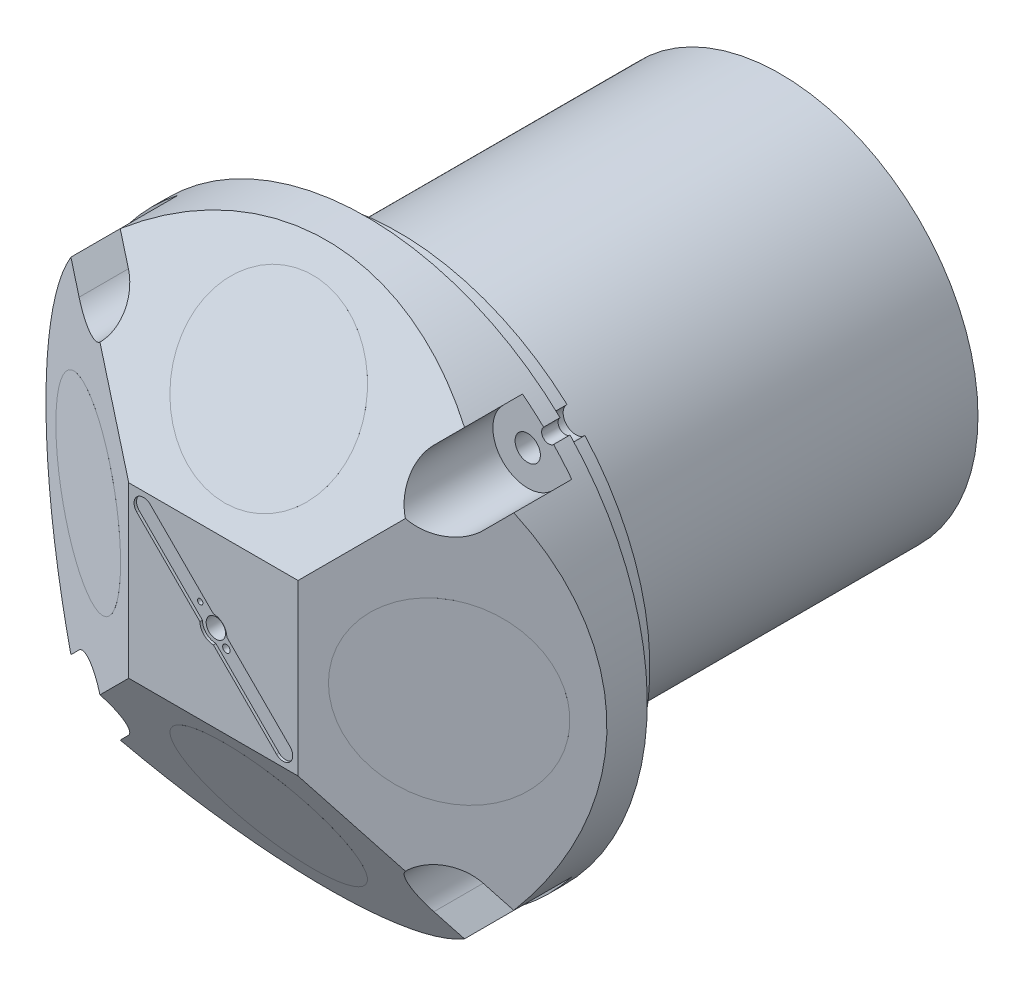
ISO-10303-21;
HEADER;
FILE_DESCRIPTION(('STEP AP214'),'2;1');
FILE_NAME('part.step','',(''),(''),'','','');
FILE_SCHEMA(('AUTOMOTIVE_DESIGN { 1 0 10303 214 1 1 1 1 }'));
ENDSEC;
DATA;
#1=APPLICATION_CONTEXT('core data for automotive mechanical design processes');
#2=APPLICATION_PROTOCOL_DEFINITION('international standard','automotive_design',2000,#1);
#3=PRODUCT_CONTEXT('',#1,'mechanical');
#4=PRODUCT('Part','Part','',(#3));
#5=PRODUCT_RELATED_PRODUCT_CATEGORY('part','',(#4));
#6=PRODUCT_DEFINITION_FORMATION('','',#4);
#7=PRODUCT_DEFINITION_CONTEXT('part definition',#1,'design');
#8=PRODUCT_DEFINITION('design','',#6,#7);
#9=PRODUCT_DEFINITION_SHAPE('','',#8);
#10=(LENGTH_UNIT() NAMED_UNIT(*) SI_UNIT(.MILLI.,.METRE.));
#11=(NAMED_UNIT(*) PLANE_ANGLE_UNIT() SI_UNIT($,.RADIAN.));
#12=(NAMED_UNIT(*) SI_UNIT($,.STERADIAN.) SOLID_ANGLE_UNIT());
#13=UNCERTAINTY_MEASURE_WITH_UNIT(LENGTH_MEASURE(1.E-05),#10,'distance_accuracy_value','');
#14=(GEOMETRIC_REPRESENTATION_CONTEXT(3) GLOBAL_UNCERTAINTY_ASSIGNED_CONTEXT((#13)) GLOBAL_UNIT_ASSIGNED_CONTEXT((#10,
#11,#12)) REPRESENTATION_CONTEXT('',''));
#15=CARTESIAN_POINT('',(0.,0.,0.));
#16=DIRECTION('',(0.,0.,1.));
#17=DIRECTION('',(1.,0.,0.));
#18=AXIS2_PLACEMENT_3D('',#15,#16,#17);
#19=CARTESIAN_POINT('',(8.88178419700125E-13,0.,153.4));
#20=DIRECTION('',(0.,0.,-1.));
#21=DIRECTION('',(-1.,0.,0.));
#22=AXIS2_PLACEMENT_3D('',#19,#20,#21);
#23=CYLINDRICAL_SURFACE('',#22,101.);
#24=CARTESIAN_POINT('',(8.88178419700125E-13,0.,140.7));
#25=DIRECTION('',(0.,0.,1.));
#26=DIRECTION('',(1.,0.,0.));
#27=AXIS2_PLACEMENT_3D('',#24,#25,#26);
#28=CIRCLE('',#27,101.);
#29=CARTESIAN_POINT('',(74.9185063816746,-67.7363816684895,140.7));
#30=VERTEX_POINT('',#29);
#31=CARTESIAN_POINT('',(74.9185063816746,67.7363816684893,140.7));
#32=VERTEX_POINT('',#31);
#33=EDGE_CURVE('E312',#30,#32,#28,.T.);
#34=ORIENTED_EDGE('',*,*,#33,.T.);
#35=DIRECTION('',(0.,0.,1.));
#36=VECTOR('',#35,1.);
#37=CARTESIAN_POINT('',(74.9185063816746,67.7363816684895,147.5));
#38=LINE('',#37,#36);
#39=CARTESIAN_POINT('',(74.9185063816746,67.7363816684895,153.4));
#40=VERTEX_POINT('',#39);
#41=EDGE_CURVE('E688',#32,#40,#38,.T.);
#42=ORIENTED_EDGE('',*,*,#41,.T.);
#43=CARTESIAN_POINT('',(8.88178419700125E-13,0.,153.4));
#44=DIRECTION('',(0.,0.,1.));
#45=DIRECTION('',(1.,0.,0.));
#46=AXIS2_PLACEMENT_3D('',#43,#44,#45);
#47=CIRCLE('',#46,101.);
#48=CARTESIAN_POINT('',(74.9185063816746,-67.7363816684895,153.4));
#49=VERTEX_POINT('',#48);
#50=EDGE_CURVE('E317',#49,#40,#47,.T.);
#51=ORIENTED_EDGE('',*,*,#50,.F.);
#52=DIRECTION('',(0.,0.,1.));
#53=VECTOR('',#52,1.);
#54=CARTESIAN_POINT('',(74.9185063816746,-67.7363816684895,147.5));
#55=LINE('',#54,#53);
#56=EDGE_CURVE('E730',#49,#30,#55,.F.);
#57=ORIENTED_EDGE('',*,*,#56,.T.);
#58=EDGE_LOOP('',(#34,#42,#51,#57));
#59=FACE_BOUND('',#58,.T.);
#60=ADVANCED_FACE('F48',(#59),#23,.T.);
#61=CARTESIAN_POINT('',(67.7363816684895,74.9185063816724,153.4));
#62=VERTEX_POINT('',#61);
#63=CARTESIAN_POINT('',(-67.7363816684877,74.9185063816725,153.4));
#64=VERTEX_POINT('',#63);
#65=EDGE_CURVE('E320',#62,#64,#47,.T.);
#66=ORIENTED_EDGE('',*,*,#65,.F.);
#67=DIRECTION('',(0.,0.,1.));
#68=VECTOR('',#67,1.);
#69=CARTESIAN_POINT('',(67.7363816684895,74.9185063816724,147.5));
#70=LINE('',#69,#68);
#71=CARTESIAN_POINT('',(67.7363816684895,74.9185063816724,140.7));
#72=VERTEX_POINT('',#71);
#73=EDGE_CURVE('E685',#62,#72,#70,.F.);
#74=ORIENTED_EDGE('',*,*,#73,.T.);
#75=CARTESIAN_POINT('',(-67.7363816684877,74.9185063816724,140.7));
#76=VERTEX_POINT('',#75);
#77=EDGE_CURVE('E324',#72,#76,#28,.T.);
#78=ORIENTED_EDGE('',*,*,#77,.T.);
#79=DIRECTION('',(0.,0.,1.));
#80=VECTOR('',#79,1.);
#81=CARTESIAN_POINT('',(-67.7363816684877,74.9185063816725,147.5));
#82=LINE('',#81,#80);
#83=EDGE_CURVE('E703',#76,#64,#82,.T.);
#84=ORIENTED_EDGE('',*,*,#83,.T.);
#85=EDGE_LOOP('',(#66,#74,#78,#84));
#86=FACE_BOUND('',#85,.T.);
#87=ADVANCED_FACE('F789',(#86),#23,.T.);
#88=CARTESIAN_POINT('',(-74.9185063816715,67.7363816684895,153.4));
#89=VERTEX_POINT('',#88);
#90=CARTESIAN_POINT('',(-74.9185063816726,-67.7363816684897,153.4));
#91=VERTEX_POINT('',#90);
#92=EDGE_CURVE('E818',#89,#91,#47,.T.);
#93=ORIENTED_EDGE('',*,*,#92,.F.);
#94=DIRECTION('',(0.,0.,1.));
#95=VECTOR('',#94,1.);
#96=CARTESIAN_POINT('',(-74.9185063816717,67.7363816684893,147.5));
#97=LINE('',#96,#95);
#98=CARTESIAN_POINT('',(-74.9185063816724,67.7363816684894,140.7));
#99=VERTEX_POINT('',#98);
#100=EDGE_CURVE('E700',#89,#99,#97,.F.);
#101=ORIENTED_EDGE('',*,*,#100,.T.);
#102=CARTESIAN_POINT('',(-74.9185063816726,-67.7363816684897,140.7));
#103=VERTEX_POINT('',#102);
#104=EDGE_CURVE('E310',#99,#103,#28,.T.);
#105=ORIENTED_EDGE('',*,*,#104,.T.);
#106=DIRECTION('',(0.,0.,1.));
#107=VECTOR('',#106,1.);
#108=CARTESIAN_POINT('',(-74.9185063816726,-67.7363816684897,147.5));
#109=LINE('',#108,#107);
#110=EDGE_CURVE('E718',#103,#91,#109,.T.);
#111=ORIENTED_EDGE('',*,*,#110,.T.);
#112=EDGE_LOOP('',(#93,#101,#105,#111));
#113=FACE_BOUND('',#112,.T.);
#114=ADVANCED_FACE('F796',(#113),#23,.T.);
#115=CARTESIAN_POINT('',(-149.859999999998,-36.98365420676,255.982431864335));
#116=DIRECTION('',(0.,0.499999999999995,0.866025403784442));
#117=DIRECTION('',(0.,-0.866025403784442,0.499999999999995));
#118=AXIS2_PLACEMENT_3D('',#115,#116,#117);
#119=PLANE('',#118);
#120=CARTESIAN_POINT('',(71.2410082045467,71.2410082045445,193.498893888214));
#121=DIRECTION('',(0.,0.499999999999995,0.866025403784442));
#122=DIRECTION('',(0.,-0.866025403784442,0.499999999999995));
#123=AXIS2_PLACEMENT_3D('',#120,#121,#122);
#124=ELLIPSE('',#123,16.1658075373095,14.);
#125=CARTESIAN_POINT('',(61.3415132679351,81.1405031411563,187.783417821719));
#126=VERTEX_POINT('',#125);
#127=CARTESIAN_POINT('',(61.3415132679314,61.3415132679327,199.214369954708));
#128=VERTEX_POINT('',#127);
#129=EDGE_CURVE('E452',#126,#128,#124,.T.);
#130=ORIENTED_EDGE('',*,*,#129,.F.);
#131=DIRECTION('',(-0.654653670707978,-0.654653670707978,0.377964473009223));
#132=VECTOR('',#131,1.);
#133=CARTESIAN_POINT('',(-96.6729394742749,-76.873949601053,279.013104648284));
#134=LINE('',#133,#132);
#135=CARTESIAN_POINT('',(69.1385417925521,88.9375316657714,183.281801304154));
#136=VERTEX_POINT('',#135);
#137=EDGE_CURVE('E427',#136,#126,#134,.T.);
#138=ORIENTED_EDGE('',*,*,#137,.F.);
#139=CARTESIAN_POINT('',(-1.99840144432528E-12,-1.66533453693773E-13,234.629909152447));
#140=DIRECTION('',(0.,0.499999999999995,0.866025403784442));
#141=DIRECTION('',(0.,0.866025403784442,-0.499999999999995));
#142=AXIS2_PLACEMENT_3D('',#139,#140,#141);
#143=ELLIPSE('',#142,130.077015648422,112.65);
#144=CARTESIAN_POINT('',(-69.1385417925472,88.9375316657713,183.281801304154));
#145=VERTEX_POINT('',#144);
#146=EDGE_CURVE('E313',#136,#145,#143,.T.);
#147=ORIENTED_EDGE('',*,*,#146,.T.);
#148=DIRECTION('',(-0.654653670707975,0.654653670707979,-0.377964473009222));
#149=VECTOR('',#148,1.);
#150=CARTESIAN_POINT('',(-31.778489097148,51.5774789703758,204.851637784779));
#151=LINE('',#150,#149);
#152=CARTESIAN_POINT('',(-61.341513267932,81.1405031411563,187.783417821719));
#153=VERTEX_POINT('',#152);
#154=EDGE_CURVE('E426',#153,#145,#151,.T.);
#155=ORIENTED_EDGE('',*,*,#154,.F.);
#156=CARTESIAN_POINT('',(-71.2410082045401,71.2410082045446,193.498893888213));
#157=DIRECTION('',(0.,0.499999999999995,0.866025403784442));
#158=DIRECTION('',(0.,-0.866025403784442,0.499999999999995));
#159=AXIS2_PLACEMENT_3D('',#156,#157,#158);
#160=ELLIPSE('',#159,16.1658075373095,14.);
#161=CARTESIAN_POINT('',(-61.3415132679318,61.3415132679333,199.214369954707));
#162=VERTEX_POINT('',#161);
#163=EDGE_CURVE('E434',#162,#153,#160,.T.);
#164=ORIENTED_EDGE('',*,*,#163,.F.);
#165=DIRECTION('',(0.65465367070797,-0.654653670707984,0.377964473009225));
#166=VECTOR('',#165,1.);
#167=CARTESIAN_POINT('',(-43.0921975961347,43.0921975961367,209.750617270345));
#168=LINE('',#167,#166);
#169=CARTESIAN_POINT('',(-33.9999999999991,33.9999999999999,215.));
#170=VERTEX_POINT('',#169);
#171=EDGE_CURVE('E336',#162,#170,#168,.T.);
#172=ORIENTED_EDGE('',*,*,#171,.T.);
#173=DIRECTION('',(-1.,0.,0.));
#174=VECTOR('',#173,1.);
#175=CARTESIAN_POINT('',(8.88178419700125E-13,34.0000000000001,215.));
#176=LINE('',#175,#174);
#177=CARTESIAN_POINT('',(34.0000000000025,34.0000000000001,215.));
#178=VERTEX_POINT('',#177);
#179=EDGE_CURVE('E333',#178,#170,#176,.T.);
#180=ORIENTED_EDGE('',*,*,#179,.F.);
#181=DIRECTION('',(0.654653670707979,0.654653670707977,-0.377964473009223));
#182=VECTOR('',#181,1.);
#183=CARTESIAN_POINT('',(-85.3592309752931,-85.3592309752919,283.91208413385));
#184=LINE('',#183,#182);
#185=EDGE_CURVE('E338',#178,#128,#184,.T.);
#186=ORIENTED_EDGE('',*,*,#185,.T.);
#187=EDGE_LOOP('',(#130,#138,#147,#155,#164,#172,#180,#186));
#188=FACE_BOUND('',#187,.T.);
#189=CARTESIAN_POINT('',(0.,72.4819568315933,192.782431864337));
#190=DIRECTION('',(0.,0.499999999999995,0.866025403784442));
#191=DIRECTION('',(0.,-0.866025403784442,0.499999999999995));
#192=AXIS2_PLACEMENT_3D('',#189,#190,#191);
#193=CIRCLE('',#192,35.5);
#194=CARTESIAN_POINT('',(0.,41.7380549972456,210.532431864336));
#195=VERTEX_POINT('',#194);
#196=EDGE_CURVE('E463',#195,#195,#193,.T.);
#197=ORIENTED_EDGE('',*,*,#196,.F.);
#198=EDGE_LOOP('',(#197));
#199=FACE_BOUND('',#198,.T.);
#200=ADVANCED_FACE('F423',(#188,#199),#119,.T.);
#201=CARTESIAN_POINT('',(-50.1818813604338,-124.46,263.602431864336));
#202=DIRECTION('',(0.499999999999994,0.,0.866025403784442));
#203=DIRECTION('',(0.866025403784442,0.,-0.499999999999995));
#204=AXIS2_PLACEMENT_3D('',#201,#202,#203);
#205=PLANE('',#204);
#206=CARTESIAN_POINT('',(71.2410082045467,-71.2410082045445,193.498893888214));
#207=DIRECTION('',(0.499999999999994,0.,0.866025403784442));
#208=DIRECTION('',(-0.866025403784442,0.,0.499999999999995));
#209=AXIS2_PLACEMENT_3D('',#206,#207,#208);
#210=ELLIPSE('',#209,16.1658075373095,14.);
#211=CARTESIAN_POINT('',(81.1405031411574,-61.3415132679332,187.78341782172));
#212=VERTEX_POINT('',#211);
#213=CARTESIAN_POINT('',(61.3415132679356,-61.3415132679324,199.214369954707));
#214=VERTEX_POINT('',#213);
#215=EDGE_CURVE('E402',#212,#214,#210,.T.);
#216=ORIENTED_EDGE('',*,*,#215,.F.);
#217=DIRECTION('',(-0.65465367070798,0.654653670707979,0.377964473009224));
#218=VECTOR('',#217,1.);
#219=CARTESIAN_POINT('',(33.1499205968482,-13.350930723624,215.490793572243));
#220=LINE('',#219,#218);
#221=CARTESIAN_POINT('',(88.9375316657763,-69.1385417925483,183.281801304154));
#222=VERTEX_POINT('',#221);
#223=EDGE_CURVE('E749',#222,#212,#220,.T.);
#224=ORIENTED_EDGE('',*,*,#223,.F.);
#225=CARTESIAN_POINT('',(-1.99840144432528E-12,-1.66533453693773E-13,234.629909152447));
#226=DIRECTION('',(0.499999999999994,0.,0.866025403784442));
#227=DIRECTION('',(0.866025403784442,0.,-0.499999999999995));
#228=AXIS2_PLACEMENT_3D('',#225,#226,#227);
#229=ELLIPSE('',#228,130.077015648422,112.65);
#230=CARTESIAN_POINT('',(88.9375316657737,69.138541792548,183.281801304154));
#231=VERTEX_POINT('',#230);
#232=EDGE_CURVE('E406',#222,#231,#229,.T.);
#233=ORIENTED_EDGE('',*,*,#232,.T.);
#234=DIRECTION('',(0.65465367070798,0.654653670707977,-0.377964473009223));
#235=VECTOR('',#234,1.);
#236=CARTESIAN_POINT('',(-73.5300794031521,-93.3290692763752,277.082520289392));
#237=LINE('',#236,#235);
#238=CARTESIAN_POINT('',(81.1405031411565,61.341513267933,187.78341782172));
#239=VERTEX_POINT('',#238);
#240=EDGE_CURVE('E531',#239,#231,#237,.T.);
#241=ORIENTED_EDGE('',*,*,#240,.F.);
#242=CARTESIAN_POINT('',(71.2410082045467,71.2410082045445,193.498893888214));
#243=DIRECTION('',(0.499999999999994,0.,0.866025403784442));
#244=DIRECTION('',(-0.866025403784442,0.,0.499999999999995));
#245=AXIS2_PLACEMENT_3D('',#242,#243,#244);
#246=ELLIPSE('',#245,16.1658075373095,14.);
#247=EDGE_CURVE('E363',#128,#239,#246,.T.);
#248=ORIENTED_EDGE('',*,*,#247,.F.);
#249=ORIENTED_EDGE('',*,*,#185,.F.);
#250=DIRECTION('',(0.,1.,0.));
#251=VECTOR('',#250,1.);
#252=CARTESIAN_POINT('',(34.0000000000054,0.,215.));
#253=LINE('',#252,#251);
#254=CARTESIAN_POINT('',(34.0000000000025,-33.9999999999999,215.));
#255=VERTEX_POINT('',#254);
#256=EDGE_CURVE('E404',#255,#178,#253,.T.);
#257=ORIENTED_EDGE('',*,*,#256,.F.);
#258=DIRECTION('',(0.654653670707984,-0.654653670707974,-0.377964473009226));
#259=VECTOR('',#258,1.);
#260=CARTESIAN_POINT('',(-70.4439453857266,70.4439453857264,275.300739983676));
#261=LINE('',#260,#259);
#262=EDGE_CURVE('E392',#255,#214,#261,.T.);
#263=ORIENTED_EDGE('',*,*,#262,.T.);
#264=EDGE_LOOP('',(#216,#224,#233,#241,#248,#249,#257,#263));
#265=FACE_BOUND('',#264,.T.);
#266=CARTESIAN_POINT('',(72.4819568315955,0.,192.782431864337));
#267=DIRECTION('',(0.499999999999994,0.,0.866025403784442));
#268=DIRECTION('',(0.866025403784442,0.,-0.499999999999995));
#269=AXIS2_PLACEMENT_3D('',#266,#267,#268);
#270=CIRCLE('',#269,35.5);
#271=CARTESIAN_POINT('',(41.7380549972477,0.,210.532431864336));
#272=VERTEX_POINT('',#271);
#273=EDGE_CURVE('E467',#272,#272,#270,.T.);
#274=ORIENTED_EDGE('',*,*,#273,.F.);
#275=EDGE_LOOP('',(#274));
#276=FACE_BOUND('',#275,.T.);
#277=ADVANCED_FACE('F399',(#265,#276),#205,.T.);
#278=CARTESIAN_POINT('',(-149.991230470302,-121.92,148.032431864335));
#279=DIRECTION('',(-0.500000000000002,0.,0.866025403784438));
#280=DIRECTION('',(0.866025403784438,0.,0.500000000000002));
#281=AXIS2_PLACEMENT_3D('',#278,#279,#280);
#282=PLANE('',#281);
#283=CARTESIAN_POINT('',(-71.2410082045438,-71.2410082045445,193.498893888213));
#284=DIRECTION('',(-0.500000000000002,0.,0.866025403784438));
#285=DIRECTION('',(0.866025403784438,0.,0.500000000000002));
#286=AXIS2_PLACEMENT_3D('',#283,#284,#285);
#287=ELLIPSE('',#286,16.1658075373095,14.);
#288=CARTESIAN_POINT('',(-61.3415132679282,-61.341513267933,199.214369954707));
#289=VERTEX_POINT('',#288);
#290=CARTESIAN_POINT('',(-81.1405031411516,-61.3415132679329,187.783417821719));
#291=VERTEX_POINT('',#290);
#292=EDGE_CURVE('E495',#289,#291,#287,.T.);
#293=ORIENTED_EDGE('',*,*,#292,.F.);
#294=DIRECTION('',(0.654653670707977,0.654653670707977,0.377964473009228));
#295=VECTOR('',#294,1.);
#296=CARTESIAN_POINT('',(-55.8303403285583,-55.8303403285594,202.396247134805));
#297=LINE('',#296,#295);
#298=CARTESIAN_POINT('',(-33.9999999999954,-33.9999999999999,215.));
#299=VERTEX_POINT('',#298);
#300=EDGE_CURVE('E416',#289,#299,#297,.T.);
#301=ORIENTED_EDGE('',*,*,#300,.T.);
#302=DIRECTION('',(0.,-1.,0.));
#303=VECTOR('',#302,1.);
#304=CARTESIAN_POINT('',(-34.000000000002,0.,215.));
#305=LINE('',#304,#303);
#306=EDGE_CURVE('E405',#170,#299,#305,.T.);
#307=ORIENTED_EDGE('',*,*,#306,.F.);
#308=ORIENTED_EDGE('',*,*,#171,.F.);
#309=CARTESIAN_POINT('',(-71.2410082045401,71.2410082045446,193.498893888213));
#310=DIRECTION('',(-0.500000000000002,0.,0.866025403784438));
#311=DIRECTION('',(0.866025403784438,0.,0.500000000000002));
#312=AXIS2_PLACEMENT_3D('',#309,#310,#311);
#313=ELLIPSE('',#312,16.1658075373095,14.);
#314=CARTESIAN_POINT('',(-81.1405031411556,61.3415132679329,187.783417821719));
#315=VERTEX_POINT('',#314);
#316=EDGE_CURVE('E353',#315,#162,#313,.T.);
#317=ORIENTED_EDGE('',*,*,#316,.F.);
#318=DIRECTION('',(0.654653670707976,-0.654653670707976,0.377964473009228));
#319=VECTOR('',#318,1.);
#320=CARTESIAN_POINT('',(-41.9431273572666,22.1441374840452,210.414033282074));
#321=LINE('',#320,#319);
#322=CARTESIAN_POINT('',(-88.9375316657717,69.138541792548,183.281801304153));
#323=VERTEX_POINT('',#322);
#324=EDGE_CURVE('E435',#323,#315,#321,.T.);
#325=ORIENTED_EDGE('',*,*,#324,.F.);
#326=CARTESIAN_POINT('',(-1.99840144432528E-12,-1.66533453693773E-13,234.629909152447));
#327=DIRECTION('',(-0.500000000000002,0.,0.866025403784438));
#328=DIRECTION('',(-0.866025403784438,0.,-0.500000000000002));
#329=AXIS2_PLACEMENT_3D('',#326,#327,#328);
#330=ELLIPSE('',#329,130.077015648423,112.65);
#331=CARTESIAN_POINT('',(-88.9375316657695,-69.1385417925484,183.281801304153));
#332=VERTEX_POINT('',#331);
#333=EDGE_CURVE('E409',#323,#332,#330,.T.);
#334=ORIENTED_EDGE('',*,*,#333,.T.);
#335=DIRECTION('',(-0.654653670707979,-0.654653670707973,-0.377964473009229));
#336=VECTOR('',#335,1.);
#337=CARTESIAN_POINT('',(-146.445984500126,-126.646994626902,150.079280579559));
#338=LINE('',#337,#336);
#339=EDGE_CURVE('E509',#291,#332,#338,.T.);
#340=ORIENTED_EDGE('',*,*,#339,.F.);
#341=EDGE_LOOP('',(#293,#301,#307,#308,#317,#325,#334,#340));
#342=FACE_BOUND('',#341,.T.);
#343=CARTESIAN_POINT('',(-72.4861689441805,0.,192.78));
#344=DIRECTION('',(-0.500000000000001,0.,0.866025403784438));
#345=DIRECTION('',(0.866025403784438,0.,0.500000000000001));
#346=AXIS2_PLACEMENT_3D('',#343,#344,#345);
#347=CIRCLE('',#346,35.5);
#348=CARTESIAN_POINT('',(-41.7422671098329,0.,210.53));
#349=VERTEX_POINT('',#348);
#350=EDGE_CURVE('E473',#349,#349,#347,.T.);
#351=ORIENTED_EDGE('',*,*,#350,.F.);
#352=EDGE_LOOP('',(#351));
#353=FACE_BOUND('',#352,.T.);
#354=ADVANCED_FACE('F491',(#342,#353),#282,.T.);
#355=CARTESIAN_POINT('',(-147.319999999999,12.7869044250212,242.012431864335));
#356=DIRECTION('',(0.,0.500000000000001,-0.866025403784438));
#357=DIRECTION('',(0.,0.866025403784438,0.500000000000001));
#358=AXIS2_PLACEMENT_3D('',#355,#356,#357);
#359=PLANE('',#358);
#360=CARTESIAN_POINT('',(-1.99840144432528E-12,-1.66533453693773E-13,234.629909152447));
#361=DIRECTION('',(0.,0.500000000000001,-0.866025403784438));
#362=DIRECTION('',(0.,-0.866025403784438,-0.500000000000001));
#363=AXIS2_PLACEMENT_3D('',#360,#361,#362);
#364=ELLIPSE('',#363,130.077015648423,112.65);
#365=CARTESIAN_POINT('',(69.138541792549,-88.9375316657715,183.281801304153));
#366=VERTEX_POINT('',#365);
#367=CARTESIAN_POINT('',(-69.1385417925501,-88.9375316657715,183.281801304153));
#368=VERTEX_POINT('',#367);
#369=EDGE_CURVE('E308',#366,#368,#364,.T.);
#370=ORIENTED_EDGE('',*,*,#369,.F.);
#371=DIRECTION('',(-0.654653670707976,0.654653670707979,0.37796447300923));
#372=VECTOR('',#371,1.);
#373=CARTESIAN_POINT('',(-81.7576538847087,61.958664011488,270.401760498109));
#374=LINE('',#373,#372);
#375=CARTESIAN_POINT('',(61.3415132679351,-81.1405031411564,187.783417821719));
#376=VERTEX_POINT('',#375);
#377=EDGE_CURVE('E394',#366,#376,#374,.T.);
#378=ORIENTED_EDGE('',*,*,#377,.T.);
#379=CARTESIAN_POINT('',(71.2410082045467,-71.2410082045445,193.498893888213));
#380=DIRECTION('',(0.,0.500000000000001,-0.866025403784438));
#381=DIRECTION('',(0.,0.866025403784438,0.500000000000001));
#382=AXIS2_PLACEMENT_3D('',#379,#380,#381);
#383=ELLIPSE('',#382,16.1658075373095,14.);
#384=EDGE_CURVE('E56',#376,#214,#383,.T.);
#385=ORIENTED_EDGE('',*,*,#384,.T.);
#386=ORIENTED_EDGE('',*,*,#262,.F.);
#387=DIRECTION('',(-1.,0.,0.));
#388=VECTOR('',#387,1.);
#389=CARTESIAN_POINT('',(1.99840144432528E-12,-33.9999999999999,215.));
#390=LINE('',#389,#388);
#391=EDGE_CURVE('E330',#255,#299,#390,.T.);
#392=ORIENTED_EDGE('',*,*,#391,.T.);
#393=ORIENTED_EDGE('',*,*,#300,.F.);
#394=CARTESIAN_POINT('',(-71.2410082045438,-71.2410082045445,193.498893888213));
#395=DIRECTION('',(0.,0.500000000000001,-0.866025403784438));
#396=DIRECTION('',(0.,0.866025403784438,0.500000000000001));
#397=AXIS2_PLACEMENT_3D('',#394,#395,#396);
#398=ELLIPSE('',#397,16.1658075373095,14.);
#399=CARTESIAN_POINT('',(-61.341513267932,-81.140503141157,187.783417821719));
#400=VERTEX_POINT('',#399);
#401=EDGE_CURVE('E373',#289,#400,#398,.T.);
#402=ORIENTED_EDGE('',*,*,#401,.T.);
#403=DIRECTION('',(-0.654653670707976,-0.654653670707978,-0.377964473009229));
#404=VECTOR('',#403,1.);
#405=CARTESIAN_POINT('',(-44.5166318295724,-64.3156217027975,197.497267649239));
#406=LINE('',#405,#404);
#407=EDGE_CURVE('E497',#400,#368,#406,.T.);
#408=ORIENTED_EDGE('',*,*,#407,.T.);
#409=EDGE_LOOP('',(#370,#378,#385,#386,#392,#393,#402,#408));
#410=FACE_BOUND('',#409,.T.);
#411=CARTESIAN_POINT('',(3.99680288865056E-12,-72.4819568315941,192.782431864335));
#412=DIRECTION('',(0.,0.500000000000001,-0.866025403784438));
#413=DIRECTION('',(0.,0.866025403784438,0.500000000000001));
#414=AXIS2_PLACEMENT_3D('',#411,#412,#413);
#415=CIRCLE('',#414,35.5);
#416=CARTESIAN_POINT('',(1.99840144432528E-12,-41.7380549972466,210.532431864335));
#417=VERTEX_POINT('',#416);
#418=EDGE_CURVE('E341',#417,#417,#415,.F.);
#419=ORIENTED_EDGE('',*,*,#418,.F.);
#420=EDGE_LOOP('',(#419));
#421=FACE_BOUND('',#420,.T.);
#422=ADVANCED_FACE('F390',(#410,#421),#359,.F.);
#423=CARTESIAN_POINT('',(1.99840144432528E-12,0.,215.));
#424=DIRECTION('',(0.,0.,-1.));
#425=DIRECTION('',(-1.,0.,0.));
#426=AXIS2_PLACEMENT_3D('',#423,#424,#425);
#427=CYLINDRICAL_SURFACE('',#426,112.65);
#428=CARTESIAN_POINT('',(8.88178419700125E-13,0.,153.4));
#429=DIRECTION('',(0.,0.,1.));
#430=DIRECTION('',(1.,0.,0.));
#431=AXIS2_PLACEMENT_3D('',#428,#429,#430);
#432=CIRCLE('',#431,112.65);
#433=CARTESIAN_POINT('',(77.6254819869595,81.6352071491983,153.4));
#434=VERTEX_POINT('',#433);
#435=CARTESIAN_POINT('',(81.6352071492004,77.6254819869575,153.4));
#436=VERTEX_POINT('',#435);
#437=EDGE_CURVE('E301',#434,#436,#432,.T.);
#438=ORIENTED_EDGE('',*,*,#437,.T.);
#439=DIRECTION('',(0.,0.,-1.));
#440=VECTOR('',#439,1.);
#441=CARTESIAN_POINT('',(81.6352071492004,77.6254819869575,184.2));
#442=LINE('',#441,#440);
#443=CARTESIAN_POINT('',(81.6352071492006,77.6254819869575,160.));
#444=VERTEX_POINT('',#443);
#445=EDGE_CURVE('E293',#436,#444,#442,.F.);
#446=ORIENTED_EDGE('',*,*,#445,.T.);
#447=CARTESIAN_POINT('',(8.88178419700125E-13,0.,160.));
#448=DIRECTION('',(0.,0.,1.));
#449=DIRECTION('',(1.,0.,0.));
#450=AXIS2_PLACEMENT_3D('',#447,#448,#449);
#451=CIRCLE('',#450,112.65);
#452=CARTESIAN_POINT('',(88.9375316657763,69.1385417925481,160.));
#453=VERTEX_POINT('',#452);
#454=EDGE_CURVE('E355',#453,#444,#451,.T.);
#455=ORIENTED_EDGE('',*,*,#454,.F.);
#456=DIRECTION('',(0.,0.,-1.));
#457=VECTOR('',#456,1.);
#458=CARTESIAN_POINT('',(88.9375316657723,69.1385417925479,215.));
#459=LINE('',#458,#457);
#460=EDGE_CURVE('E358',#453,#231,#459,.F.);
#461=ORIENTED_EDGE('',*,*,#460,.T.);
#462=ORIENTED_EDGE('',*,*,#232,.F.);
#463=DIRECTION('',(0.,0.,-1.));
#464=VECTOR('',#463,1.);
#465=CARTESIAN_POINT('',(88.9375316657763,-69.138541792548,215.));
#466=LINE('',#465,#464);
#467=CARTESIAN_POINT('',(88.9375316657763,-69.1385417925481,160.));
#468=VERTEX_POINT('',#467);
#469=EDGE_CURVE('E379',#222,#468,#466,.T.);
#470=ORIENTED_EDGE('',*,*,#469,.T.);
#471=CARTESIAN_POINT('',(8.88178419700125E-13,0.,160.));
#472=DIRECTION('',(0.,0.,-1.));
#473=DIRECTION('',(-1.,0.,0.));
#474=AXIS2_PLACEMENT_3D('',#471,#472,#473);
#475=CIRCLE('',#474,112.65);
#476=CARTESIAN_POINT('',(69.1385417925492,-88.9375316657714,160.));
#477=VERTEX_POINT('',#476);
#478=EDGE_CURVE('E376',#468,#477,#475,.T.);
#479=ORIENTED_EDGE('',*,*,#478,.T.);
#480=DIRECTION('',(0.,0.,-1.));
#481=VECTOR('',#480,1.);
#482=CARTESIAN_POINT('',(69.1385417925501,-88.9375316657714,215.));
#483=LINE('',#482,#481);
#484=EDGE_CURVE('E382',#477,#366,#483,.F.);
#485=ORIENTED_EDGE('',*,*,#484,.T.);
#486=ORIENTED_EDGE('',*,*,#369,.T.);
#487=DIRECTION('',(0.,0.,-1.));
#488=VECTOR('',#487,1.);
#489=CARTESIAN_POINT('',(-69.1385417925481,-88.9375316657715,215.));
#490=LINE('',#489,#488);
#491=CARTESIAN_POINT('',(-69.1385417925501,-88.9375316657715,160.));
#492=VERTEX_POINT('',#491);
#493=EDGE_CURVE('E370',#368,#492,#490,.T.);
#494=ORIENTED_EDGE('',*,*,#493,.T.);
#495=CARTESIAN_POINT('',(8.88178419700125E-13,0.,160.));
#496=DIRECTION('',(0.,0.,1.));
#497=DIRECTION('',(1.,0.,0.));
#498=AXIS2_PLACEMENT_3D('',#495,#496,#497);
#499=CIRCLE('',#498,112.65);
#500=CARTESIAN_POINT('',(-88.9375316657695,-69.138541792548,160.));
#501=VERTEX_POINT('',#500);
#502=EDGE_CURVE('E365',#501,#492,#499,.T.);
#503=ORIENTED_EDGE('',*,*,#502,.F.);
#504=DIRECTION('',(0.,0.,-1.));
#505=VECTOR('',#504,1.);
#506=CARTESIAN_POINT('',(-88.937531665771,-69.138541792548,215.));
#507=LINE('',#506,#505);
#508=EDGE_CURVE('E367',#501,#332,#507,.F.);
#509=ORIENTED_EDGE('',*,*,#508,.T.);
#510=ORIENTED_EDGE('',*,*,#333,.F.);
#511=DIRECTION('',(0.,0.,-1.));
#512=VECTOR('',#511,1.);
#513=CARTESIAN_POINT('',(-88.9375316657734,69.138541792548,215.));
#514=LINE('',#513,#512);
#515=CARTESIAN_POINT('',(-88.9375316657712,69.138541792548,160.));
#516=VERTEX_POINT('',#515);
#517=EDGE_CURVE('E347',#323,#516,#514,.T.);
#518=ORIENTED_EDGE('',*,*,#517,.T.);
#519=CARTESIAN_POINT('',(8.88178419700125E-13,0.,160.));
#520=DIRECTION('',(0.,0.,-1.));
#521=DIRECTION('',(-1.,0.,0.));
#522=AXIS2_PLACEMENT_3D('',#519,#520,#521);
#523=CIRCLE('',#522,112.65);
#524=CARTESIAN_POINT('',(-69.1385417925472,88.9375316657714,160.));
#525=VERTEX_POINT('',#524);
#526=EDGE_CURVE('E344',#516,#525,#523,.T.);
#527=ORIENTED_EDGE('',*,*,#526,.T.);
#528=DIRECTION('',(0.,0.,-1.));
#529=VECTOR('',#528,1.);
#530=CARTESIAN_POINT('',(-69.1385417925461,88.9375316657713,215.));
#531=LINE('',#530,#529);
#532=EDGE_CURVE('E350',#525,#145,#531,.F.);
#533=ORIENTED_EDGE('',*,*,#532,.T.);
#534=ORIENTED_EDGE('',*,*,#146,.F.);
#535=DIRECTION('',(0.,0.,-1.));
#536=VECTOR('',#535,1.);
#537=CARTESIAN_POINT('',(69.138541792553,88.9375316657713,215.));
#538=LINE('',#537,#536);
#539=CARTESIAN_POINT('',(69.1385417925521,88.9375316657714,160.));
#540=VERTEX_POINT('',#539);
#541=EDGE_CURVE('E361',#136,#540,#538,.T.);
#542=ORIENTED_EDGE('',*,*,#541,.T.);
#543=CARTESIAN_POINT('',(77.6254819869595,81.6352071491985,160.));
#544=VERTEX_POINT('',#543);
#545=EDGE_CURVE('E303',#544,#540,#451,.T.);
#546=ORIENTED_EDGE('',*,*,#545,.F.);
#547=DIRECTION('',(0.,0.,-1.));
#548=VECTOR('',#547,1.);
#549=CARTESIAN_POINT('',(77.6254819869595,81.6352071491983,184.2));
#550=LINE('',#549,#548);
#551=EDGE_CURVE('E62',#544,#434,#550,.T.);
#552=ORIENTED_EDGE('',*,*,#551,.T.);
#553=EDGE_LOOP('',(#438,#446,#455,#461,#462,#470,#479,#485,#486,#494,#503,#509,#510,#518,#527,
#533,#534,#542,#546,#552));
#554=FACE_BOUND('',#553,.T.);
#555=ADVANCED_FACE('F300',(#554),#427,.T.);
#556=CARTESIAN_POINT('',(1.99840144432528E-12,0.,215.));
#557=DIRECTION('',(0.,0.,1.));
#558=DIRECTION('',(1.,0.,0.));
#559=AXIS2_PLACEMENT_3D('',#556,#557,#558);
#560=PLANE('',#559);
#561=CARTESIAN_POINT('',(-28.0466049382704,28.0466049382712,215.));
#562=DIRECTION('',(0.,0.,1.));
#563=DIRECTION('',(-1.,0.,0.));
#564=AXIS2_PLACEMENT_3D('',#561,#562,#563);
#565=CIRCLE('',#564,3.81791445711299);
#566=CARTESIAN_POINT('',(-25.3469317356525,30.7462781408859,215.));
#567=VERTEX_POINT('',#566);
#568=CARTESIAN_POINT('',(-30.746278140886,25.3469317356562,215.));
#569=VERTEX_POINT('',#568);
#570=EDGE_CURVE('E70',#567,#569,#565,.T.);
#571=ORIENTED_EDGE('',*,*,#570,.F.);
#572=DIRECTION('',(-0.707106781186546,0.707106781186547,0.));
#573=VECTOR('',#572,1.);
#574=CARTESIAN_POINT('',(-25.3469317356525,30.7462781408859,215.));
#575=LINE('',#574,#573);
#576=CARTESIAN_POINT('',(4.66293670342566E-12,5.3993464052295,215.));
#577=VERTEX_POINT('',#576);
#578=EDGE_CURVE('E621',#577,#567,#575,.T.);
#579=ORIENTED_EDGE('',*,*,#578,.F.);
#580=CARTESIAN_POINT('',(1.99840144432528E-12,0.,215.));
#581=DIRECTION('',(0.,0.,1.));
#582=DIRECTION('',(1.,0.,0.));
#583=AXIS2_PLACEMENT_3D('',#580,#581,#582);
#584=CIRCLE('',#583,5.39934640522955);
#585=CARTESIAN_POINT('',(5.39934640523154,-1.2490009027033E-13,215.));
#586=VERTEX_POINT('',#585);
#587=EDGE_CURVE('E659',#586,#577,#584,.T.);
#588=ORIENTED_EDGE('',*,*,#587,.F.);
#589=DIRECTION('',(-0.707106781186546,0.707106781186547,0.));
#590=VECTOR('',#589,1.);
#591=CARTESIAN_POINT('',(5.39934640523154,-1.2490009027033E-13,215.));
#592=LINE('',#591,#590);
#593=CARTESIAN_POINT('',(30.7462781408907,-25.3469317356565,215.));
#594=VERTEX_POINT('',#593);
#595=EDGE_CURVE('E656',#594,#586,#592,.T.);
#596=ORIENTED_EDGE('',*,*,#595,.F.);
#597=CARTESIAN_POINT('',(28.0466049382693,-28.0466049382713,215.));
#598=DIRECTION('',(0.,0.,1.));
#599=DIRECTION('',(1.,0.,0.));
#600=AXIS2_PLACEMENT_3D('',#597,#598,#599);
#601=CIRCLE('',#600,3.81791445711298);
#602=CARTESIAN_POINT('',(25.3469317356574,-30.7462781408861,215.));
#603=VERTEX_POINT('',#602);
#604=EDGE_CURVE('E653',#603,#594,#601,.T.);
#605=ORIENTED_EDGE('',*,*,#604,.F.);
#606=DIRECTION('',(0.707106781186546,-0.707106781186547,0.));
#607=VECTOR('',#606,1.);
#608=CARTESIAN_POINT('',(-1.99840144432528E-12,-5.39934640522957,215.));
#609=LINE('',#608,#607);
#610=CARTESIAN_POINT('',(-1.99840144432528E-12,-5.39934640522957,215.));
#611=VERTEX_POINT('',#610);
#612=EDGE_CURVE('E650',#611,#603,#609,.T.);
#613=ORIENTED_EDGE('',*,*,#612,.F.);
#614=CARTESIAN_POINT('',(1.99840144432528E-12,0.,215.));
#615=DIRECTION('',(0.,0.,1.));
#616=DIRECTION('',(1.,0.,0.));
#617=AXIS2_PLACEMENT_3D('',#614,#615,#616);
#618=CIRCLE('',#617,5.39934640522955);
#619=CARTESIAN_POINT('',(-5.39934640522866,0.,215.));
#620=VERTEX_POINT('',#619);
#621=EDGE_CURVE('E647',#620,#611,#618,.T.);
#622=ORIENTED_EDGE('',*,*,#621,.F.);
#623=DIRECTION('',(0.707106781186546,-0.707106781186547,0.));
#624=VECTOR('',#623,1.);
#625=CARTESIAN_POINT('',(-30.746278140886,25.3469317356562,215.));
#626=LINE('',#625,#624);
#627=EDGE_CURVE('E644',#569,#620,#626,.T.);
#628=ORIENTED_EDGE('',*,*,#627,.F.);
#629=EDGE_LOOP('',(#571,#579,#588,#596,#605,#613,#622,#628));
#630=FACE_BOUND('',#629,.T.);
#631=ORIENTED_EDGE('',*,*,#391,.F.);
#632=ORIENTED_EDGE('',*,*,#256,.T.);
#633=ORIENTED_EDGE('',*,*,#179,.T.);
#634=ORIENTED_EDGE('',*,*,#306,.T.);
#635=EDGE_LOOP('',(#631,#632,#633,#634));
#636=FACE_BOUND('',#635,.T.);
#637=ADVANCED_FACE('F485',(#630,#636),#560,.T.);
#638=CARTESIAN_POINT('',(8.88178419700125E-13,0.,15.2399999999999));
#639=DIRECTION('',(0.,0.,-1.));
#640=DIRECTION('',(-1.,0.,0.));
#641=AXIS2_PLACEMENT_3D('',#638,#639,#640);
#642=CYLINDRICAL_SURFACE('',#641,79.375);
#643=CARTESIAN_POINT('',(0.,-2.4980018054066E-13,-12.6999999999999));
#644=DIRECTION('',(0.,0.,1.));
#645=DIRECTION('',(1.,0.,0.));
#646=AXIS2_PLACEMENT_3D('',#643,#644,#645);
#647=CIRCLE('',#646,79.375);
#648=CARTESIAN_POINT('',(79.375,-2.4980018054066E-13,-12.6999999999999));
#649=VERTEX_POINT('',#648);
#650=EDGE_CURVE('E327',#649,#649,#647,.T.);
#651=ORIENTED_EDGE('',*,*,#650,.T.);
#652=EDGE_LOOP('',(#651));
#653=FACE_BOUND('',#652,.T.);
#654=CARTESIAN_POINT('',(8.88178419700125E-13,0.,140.7));
#655=DIRECTION('',(0.,0.,1.));
#656=DIRECTION('',(1.,0.,0.));
#657=AXIS2_PLACEMENT_3D('',#654,#655,#656);
#658=CIRCLE('',#657,79.375);
#659=CARTESIAN_POINT('',(79.3750000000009,0.,140.7));
#660=VERTEX_POINT('',#659);
#661=EDGE_CURVE('E319',#660,#660,#658,.T.);
#662=ORIENTED_EDGE('',*,*,#661,.F.);
#663=EDGE_LOOP('',(#662));
#664=FACE_BOUND('',#663,.T.);
#665=ADVANCED_FACE('F50',(#653,#664),#642,.T.);
#666=CARTESIAN_POINT('',(0.,-2.4980018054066E-13,-12.6999999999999));
#667=DIRECTION('',(0.,0.,1.));
#668=DIRECTION('',(1.,0.,0.));
#669=AXIS2_PLACEMENT_3D('',#666,#667,#668);
#670=PLANE('',#669);
#671=CARTESIAN_POINT('',(47.7786265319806,0.,-12.6999999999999));
#672=DIRECTION('',(0.,0.,-1.));
#673=DIRECTION('',(1.,0.,0.));
#674=AXIS2_PLACEMENT_3D('',#671,#672,#673);
#675=CIRCLE('',#674,10.);
#676=CARTESIAN_POINT('',(57.7786265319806,0.,-12.6999999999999));
#677=VERTEX_POINT('',#676);
#678=EDGE_CURVE('E573',#677,#677,#675,.T.);
#679=ORIENTED_EDGE('',*,*,#678,.F.);
#680=EDGE_LOOP('',(#679));
#681=FACE_BOUND('',#680,.T.);
#682=CARTESIAN_POINT('',(8.88178419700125E-13,-47.7786265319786,-12.6999999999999));
#683=DIRECTION('',(0.,0.,-1.));
#684=DIRECTION('',(1.,0.,0.));
#685=AXIS2_PLACEMENT_3D('',#682,#683,#684);
#686=CIRCLE('',#685,10.);
#687=CARTESIAN_POINT('',(10.0000000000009,-47.7786265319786,-12.6999999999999));
#688=VERTEX_POINT('',#687);
#689=EDGE_CURVE('E579',#688,#688,#686,.T.);
#690=ORIENTED_EDGE('',*,*,#689,.F.);
#691=EDGE_LOOP('',(#690));
#692=FACE_BOUND('',#691,.T.);
#693=CARTESIAN_POINT('',(-47.7786265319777,0.,-12.6999999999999));
#694=DIRECTION('',(0.,0.,-1.));
#695=DIRECTION('',(-1.,0.,0.));
#696=AXIS2_PLACEMENT_3D('',#693,#694,#695);
#697=CIRCLE('',#696,10.);
#698=CARTESIAN_POINT('',(-57.7786265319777,0.,-12.6999999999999));
#699=VERTEX_POINT('',#698);
#700=EDGE_CURVE('E585',#699,#699,#697,.T.);
#701=ORIENTED_EDGE('',*,*,#700,.F.);
#702=EDGE_LOOP('',(#701));
#703=FACE_BOUND('',#702,.T.);
#704=CARTESIAN_POINT('',(3.99680288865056E-12,47.7786265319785,-12.6999999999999));
#705=DIRECTION('',(0.,0.,-1.));
#706=DIRECTION('',(-1.,0.,0.));
#707=AXIS2_PLACEMENT_3D('',#704,#705,#706);
#708=CIRCLE('',#707,10.);
#709=CARTESIAN_POINT('',(-9.999999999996,47.7786265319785,-12.6999999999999));
#710=VERTEX_POINT('',#709);
#711=EDGE_CURVE('E591',#710,#710,#708,.T.);
#712=ORIENTED_EDGE('',*,*,#711,.F.);
#713=EDGE_LOOP('',(#712));
#714=FACE_BOUND('',#713,.T.);
#715=ORIENTED_EDGE('',*,*,#650,.F.);
#716=EDGE_LOOP('',(#715));
#717=FACE_BOUND('',#716,.T.);
#718=ADVANCED_FACE('F808',(#681,#692,#703,#714,#717),#670,.F.);
#719=CARTESIAN_POINT('',(8.88178419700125E-13,0.,140.7));
#720=DIRECTION('',(0.,0.,1.));
#721=DIRECTION('',(1.,0.,0.));
#722=AXIS2_PLACEMENT_3D('',#719,#720,#721);
#723=PLANE('',#722);
#724=ORIENTED_EDGE('',*,*,#77,.F.);
#725=CARTESIAN_POINT('',(71.2410082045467,71.2410082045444,140.7));
#726=DIRECTION('',(0.,0.,1.));
#727=DIRECTION('',(1.,0.,0.));
#728=AXIS2_PLACEMENT_3D('',#725,#726,#727);
#729=CIRCLE('',#728,5.08000000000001);
#730=EDGE_CURVE('E691',#72,#32,#729,.T.);
#731=ORIENTED_EDGE('',*,*,#730,.T.);
#732=ORIENTED_EDGE('',*,*,#33,.F.);
#733=CARTESIAN_POINT('',(71.2410082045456,-71.2410082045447,140.7));
#734=DIRECTION('',(0.,0.,1.));
#735=DIRECTION('',(1.,0.,0.));
#736=AXIS2_PLACEMENT_3D('',#733,#734,#735);
#737=CIRCLE('',#736,5.08000000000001);
#738=CARTESIAN_POINT('',(67.7363816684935,-74.9185063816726,140.7));
#739=VERTEX_POINT('',#738);
#740=EDGE_CURVE('E736',#30,#739,#737,.T.);
#741=ORIENTED_EDGE('',*,*,#740,.T.);
#742=CARTESIAN_POINT('',(-67.7363816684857,-74.9185063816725,140.7));
#743=VERTEX_POINT('',#742);
#744=EDGE_CURVE('E307',#743,#739,#28,.T.);
#745=ORIENTED_EDGE('',*,*,#744,.F.);
#746=CARTESIAN_POINT('',(-71.2410082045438,-71.2410082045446,140.7));
#747=DIRECTION('',(0.,0.,1.));
#748=DIRECTION('',(1.,0.,0.));
#749=AXIS2_PLACEMENT_3D('',#746,#747,#748);
#750=CIRCLE('',#749,5.08000000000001);
#751=EDGE_CURVE('E721',#743,#103,#750,.T.);
#752=ORIENTED_EDGE('',*,*,#751,.T.);
#753=ORIENTED_EDGE('',*,*,#104,.F.);
#754=CARTESIAN_POINT('',(-71.2410082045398,71.2410082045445,140.7));
#755=DIRECTION('',(0.,0.,1.));
#756=DIRECTION('',(1.,0.,0.));
#757=AXIS2_PLACEMENT_3D('',#754,#755,#756);
#758=CIRCLE('',#757,5.08000000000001);
#759=EDGE_CURVE('E706',#99,#76,#758,.T.);
#760=ORIENTED_EDGE('',*,*,#759,.T.);
#761=EDGE_LOOP('',(#724,#731,#732,#741,#745,#752,#753,#760));
#762=FACE_BOUND('',#761,.T.);
#763=ORIENTED_EDGE('',*,*,#661,.T.);
#764=EDGE_LOOP('',(#763));
#765=FACE_BOUND('',#764,.T.);
#766=ADVANCED_FACE('F800',(#762,#765),#723,.F.);
#767=CARTESIAN_POINT('',(-67.7363816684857,-74.9185063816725,153.4));
#768=VERTEX_POINT('',#767);
#769=CARTESIAN_POINT('',(67.7363816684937,-74.9185063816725,153.4));
#770=VERTEX_POINT('',#769);
#771=EDGE_CURVE('E321',#768,#770,#47,.T.);
#772=ORIENTED_EDGE('',*,*,#771,.F.);
#773=DIRECTION('',(0.,0.,1.));
#774=VECTOR('',#773,1.);
#775=CARTESIAN_POINT('',(-67.7363816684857,-74.9185063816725,147.5));
#776=LINE('',#775,#774);
#777=EDGE_CURVE('E715',#768,#743,#776,.F.);
#778=ORIENTED_EDGE('',*,*,#777,.T.);
#779=ORIENTED_EDGE('',*,*,#744,.T.);
#780=DIRECTION('',(0.,0.,1.));
#781=VECTOR('',#780,1.);
#782=CARTESIAN_POINT('',(67.7363816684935,-74.9185063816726,147.5));
#783=LINE('',#782,#781);
#784=EDGE_CURVE('E733',#739,#770,#783,.T.);
#785=ORIENTED_EDGE('',*,*,#784,.T.);
#786=EDGE_LOOP('',(#772,#778,#779,#785));
#787=FACE_BOUND('',#786,.T.);
#788=ADVANCED_FACE('F792',(#787),#23,.T.);
#789=CARTESIAN_POINT('',(8.88178419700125E-13,0.,153.4));
#790=DIRECTION('',(0.,0.,1.));
#791=DIRECTION('',(1.,0.,0.));
#792=AXIS2_PLACEMENT_3D('',#789,#790,#791);
#793=PLANE('',#792);
#794=ORIENTED_EDGE('',*,*,#437,.F.);
#795=CARTESIAN_POINT('',(79.6555789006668,79.6555789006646,153.4));
#796=DIRECTION('',(0.,0.,-1.));
#797=DIRECTION('',(-1.,0.,0.));
#798=AXIS2_PLACEMENT_3D('',#795,#796,#797);
#799=CIRCLE('',#798,2.83552843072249);
#800=EDGE_CURVE('E290',#436,#434,#799,.T.);
#801=ORIENTED_EDGE('',*,*,#800,.F.);
#802=EDGE_LOOP('',(#794,#801));
#803=FACE_BOUND('',#802,.T.);
#804=ORIENTED_EDGE('',*,*,#50,.T.);
#805=CARTESIAN_POINT('',(71.2410082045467,71.2410082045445,153.4));
#806=DIRECTION('',(0.,0.,1.));
#807=DIRECTION('',(1.,0.,0.));
#808=AXIS2_PLACEMENT_3D('',#805,#806,#807);
#809=CIRCLE('',#808,5.08000000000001);
#810=EDGE_CURVE('E682',#40,#62,#809,.T.);
#811=ORIENTED_EDGE('',*,*,#810,.T.);
#812=ORIENTED_EDGE('',*,*,#65,.T.);
#813=CARTESIAN_POINT('',(-71.2410082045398,71.2410082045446,153.4));
#814=DIRECTION('',(0.,0.,1.));
#815=DIRECTION('',(1.,0.,0.));
#816=AXIS2_PLACEMENT_3D('',#813,#814,#815);
#817=CIRCLE('',#816,5.08000000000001);
#818=EDGE_CURVE('E697',#64,#89,#817,.T.);
#819=ORIENTED_EDGE('',*,*,#818,.T.);
#820=ORIENTED_EDGE('',*,*,#92,.T.);
#821=CARTESIAN_POINT('',(-71.2410082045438,-71.2410082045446,153.4));
#822=DIRECTION('',(0.,0.,1.));
#823=DIRECTION('',(1.,0.,0.));
#824=AXIS2_PLACEMENT_3D('',#821,#822,#823);
#825=CIRCLE('',#824,5.08000000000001);
#826=EDGE_CURVE('E712',#91,#768,#825,.T.);
#827=ORIENTED_EDGE('',*,*,#826,.T.);
#828=ORIENTED_EDGE('',*,*,#771,.T.);
#829=CARTESIAN_POINT('',(71.2410082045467,-71.2410082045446,153.4));
#830=DIRECTION('',(0.,0.,1.));
#831=DIRECTION('',(1.,0.,0.));
#832=AXIS2_PLACEMENT_3D('',#829,#830,#831);
#833=CIRCLE('',#832,5.08000000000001);
#834=EDGE_CURVE('E727',#770,#49,#833,.T.);
#835=ORIENTED_EDGE('',*,*,#834,.T.);
#836=EDGE_LOOP('',(#804,#811,#812,#819,#820,#827,#828,#835));
#837=FACE_BOUND('',#836,.T.);
#838=ADVANCED_FACE('F305',(#803,#837),#793,.F.);
#839=CARTESIAN_POINT('',(1.99840144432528E-12,-72.4844568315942,192.786761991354));
#840=DIRECTION('',(0.,0.500000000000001,-0.866025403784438));
#841=DIRECTION('',(0.,0.866025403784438,0.500000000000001));
#842=AXIS2_PLACEMENT_3D('',#839,#840,#841);
#843=CYLINDRICAL_SURFACE('',#842,35.5);
#844=CARTESIAN_POINT('',(1.99840144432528E-12,-72.4844568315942,192.786761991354));
#845=DIRECTION('',(0.,-0.500000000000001,0.866025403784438));
#846=DIRECTION('',(0.,-0.866025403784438,-0.500000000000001));
#847=AXIS2_PLACEMENT_3D('',#844,#845,#846);
#848=CIRCLE('',#847,35.5);
#849=CARTESIAN_POINT('',(1.99840144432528E-12,-41.7405549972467,210.536761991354));
#850=VERTEX_POINT('',#849);
#851=EDGE_CURVE('E479',#850,#850,#848,.T.);
#852=CARTESIAN_POINT('',(1.99840144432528E-12,-41.7405549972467,210.536761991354));
#853=CARTESIAN_POINT('',(1.99840144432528E-12,-41.74052895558,210.536716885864));
#854=CARTESIAN_POINT('',(1.99840144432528E-12,-41.7405029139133,210.536671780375));
#855=CARTESIAN_POINT('',(1.99840144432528E-12,-41.74045083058,210.536581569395));
#856=CARTESIAN_POINT('',(1.99840144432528E-12,-41.7404247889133,210.536536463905));
#857=CARTESIAN_POINT('',(1.99840144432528E-12,-41.74037270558,210.536446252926));
#858=CARTESIAN_POINT('',(1.99840144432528E-12,-41.7403466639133,210.536401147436));
#859=CARTESIAN_POINT('',(1.99840144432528E-12,-41.74029458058,210.536310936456));
#860=CARTESIAN_POINT('',(1.99840144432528E-12,-41.7402685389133,210.536265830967));
#861=CARTESIAN_POINT('',(1.99840144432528E-12,-41.74021645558,210.536175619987));
#862=CARTESIAN_POINT('',(1.99840144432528E-12,-41.7401904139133,210.536130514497));
#863=CARTESIAN_POINT('',(1.99840144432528E-12,-41.74013833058,210.536040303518));
#864=CARTESIAN_POINT('',(1.99840144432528E-12,-41.7401122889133,210.535995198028));
#865=CARTESIAN_POINT('',(1.99840144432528E-12,-41.74006020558,210.535904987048));
#866=CARTESIAN_POINT('',(1.99840144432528E-12,-41.7400341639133,210.535859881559));
#867=CARTESIAN_POINT('',(1.99840144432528E-12,-41.73998208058,210.535769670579));
#868=CARTESIAN_POINT('',(1.99840144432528E-12,-41.7399560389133,210.535724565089));
#869=CARTESIAN_POINT('',(1.99840144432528E-12,-41.73990395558,210.53563435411));
#870=CARTESIAN_POINT('',(1.99840144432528E-12,-41.7398779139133,210.53558924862));
#871=CARTESIAN_POINT('',(1.99840144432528E-12,-41.73982583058,210.53549903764));
#872=CARTESIAN_POINT('',(1.99840144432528E-12,-41.7397997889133,210.535453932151));
#873=CARTESIAN_POINT('',(1.99840144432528E-12,-41.73974770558,210.535363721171));
#874=CARTESIAN_POINT('',(1.99840144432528E-12,-41.7397216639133,210.535318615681));
#875=CARTESIAN_POINT('',(1.99840144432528E-12,-41.73966958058,210.535228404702));
#876=CARTESIAN_POINT('',(1.99840144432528E-12,-41.7396435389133,210.535183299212));
#877=CARTESIAN_POINT('',(1.99840144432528E-12,-41.73959145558,210.535093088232));
#878=CARTESIAN_POINT('',(1.99840144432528E-12,-41.7395654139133,210.535047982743));
#879=CARTESIAN_POINT('',(1.99840144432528E-12,-41.73951333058,210.534957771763));
#880=CARTESIAN_POINT('',(1.99840144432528E-12,-41.7394872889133,210.534912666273));
#881=CARTESIAN_POINT('',(1.99840144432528E-12,-41.73943520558,210.534822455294));
#882=CARTESIAN_POINT('',(1.99840144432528E-12,-41.7394091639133,210.534777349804));
#883=CARTESIAN_POINT('',(1.99840144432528E-12,-41.73935708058,210.534687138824));
#884=CARTESIAN_POINT('',(1.99840144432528E-12,-41.7393310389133,210.534642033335));
#885=CARTESIAN_POINT('',(1.99840144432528E-12,-41.73927895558,210.534551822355));
#886=CARTESIAN_POINT('',(1.99840144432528E-12,-41.7392529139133,210.534506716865));
#887=CARTESIAN_POINT('',(1.99840144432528E-12,-41.73920083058,210.534416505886));
#888=CARTESIAN_POINT('',(1.99840144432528E-12,-41.7391747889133,210.534371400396));
#889=CARTESIAN_POINT('',(1.99840144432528E-12,-41.73912270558,210.534281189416));
#890=CARTESIAN_POINT('',(1.99840144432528E-12,-41.7390966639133,210.534236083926));
#891=CARTESIAN_POINT('',(1.99840144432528E-12,-41.73904458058,210.534145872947));
#892=CARTESIAN_POINT('',(1.99840144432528E-12,-41.7390185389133,210.534100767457));
#893=CARTESIAN_POINT('',(1.99840144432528E-12,-41.73896645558,210.534010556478));
#894=CARTESIAN_POINT('',(1.99840144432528E-12,-41.7389404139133,210.533965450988));
#895=CARTESIAN_POINT('',(1.99840144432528E-12,-41.73888833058,210.533875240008));
#896=CARTESIAN_POINT('',(1.99840144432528E-12,-41.7388622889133,210.533830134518));
#897=CARTESIAN_POINT('',(1.99840144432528E-12,-41.73881020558,210.533739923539));
#898=CARTESIAN_POINT('',(1.99840144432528E-12,-41.7387841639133,210.533694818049));
#899=CARTESIAN_POINT('',(1.99840144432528E-12,-41.73873208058,210.53360460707));
#900=CARTESIAN_POINT('',(1.99840144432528E-12,-41.7387060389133,210.53355950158));
#901=CARTESIAN_POINT('',(1.99840144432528E-12,-41.73865395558,210.5334692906));
#902=CARTESIAN_POINT('',(1.99840144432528E-12,-41.7386279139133,210.53342418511));
#903=CARTESIAN_POINT('',(1.99840144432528E-12,-41.73857583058,210.533333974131));
#904=CARTESIAN_POINT('',(1.99840144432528E-12,-41.7385497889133,210.533288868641));
#905=CARTESIAN_POINT('',(1.99840144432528E-12,-41.73849770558,210.533198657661));
#906=CARTESIAN_POINT('',(1.99840144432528E-12,-41.7384716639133,210.533153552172));
#907=CARTESIAN_POINT('',(1.99840144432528E-12,-41.73841958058,210.533063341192));
#908=CARTESIAN_POINT('',(1.99840144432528E-12,-41.7383935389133,210.533018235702));
#909=CARTESIAN_POINT('',(1.99840144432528E-12,-41.73834145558,210.532928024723));
#910=CARTESIAN_POINT('',(1.99840144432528E-12,-41.7383154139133,210.532882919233));
#911=CARTESIAN_POINT('',(1.99840144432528E-12,-41.73826333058,210.532792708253));
#912=CARTESIAN_POINT('',(1.99840144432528E-12,-41.7382372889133,210.532747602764));
#913=CARTESIAN_POINT('',(1.99840144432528E-12,-41.73818520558,210.532657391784));
#914=CARTESIAN_POINT('',(1.99840144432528E-12,-41.7381591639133,210.532612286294));
#915=CARTESIAN_POINT('',(1.99840144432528E-12,-41.73810708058,210.532522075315));
#916=CARTESIAN_POINT('',(1.99840144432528E-12,-41.7380810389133,210.532476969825));
#917=CARTESIAN_POINT('',(1.99840144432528E-12,-41.7380549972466,210.532431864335));
#918=B_SPLINE_CURVE_WITH_KNOTS('',3,(#852,#853,#854,#855,#856,#857,#858,#859,#860,#861,#862,
#863,#864,#865,#866,#867,#868,#869,#870,#871,#872,#873,#874,#875,#876,#877,#878,#879,#880,#881,
#882,#883,#884,#885,#886,#887,#888,#889,#890,#891,#892,#893,#894,#895,#896,#897,#898,#899,#900,
#901,#902,#903,#904,#905,#906,#907,#908,#909,#910,#911,#912,#913,#914,#915,#916,#917),
.UNSPECIFIED.,.F.,.F.,(4,2,2,2,2,2,2,2,2,2,2,2,2,2,2,2,2,2,2,2,2,2,2,2,2,2,2,2,2,2,2,2,4),(0.,
0.000156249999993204,0.000312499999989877,0.00046874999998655,0.00062500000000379,
0.000781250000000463,0.000937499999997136,0.00109375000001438,0.00125000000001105,
0.00140625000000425,0.00156250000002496,0.00171875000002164,0.00187500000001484,
0.00203125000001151,0.00218750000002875,0.00234375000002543,0.0025000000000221,
0.00265625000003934,0.00281250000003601,0.00296875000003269,0.00312500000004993,
0.0032812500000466,0.0034375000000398,0.00359375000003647,0.00375000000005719,
0.00390625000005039,0.00406250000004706,0.0042187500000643,0.00437500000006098,
0.00453125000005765,0.00468750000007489,0.00484375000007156,0.00500000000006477),.UNSPECIFIED.);
#919=EDGE_CURVE('BSEAM806',#850,#417,#918,.T.);
#920=ORIENTED_EDGE('',*,*,#851,.F.);
#921=ORIENTED_EDGE('',*,*,#418,.T.);
#922=ORIENTED_EDGE('',*,*,#919,.T.);
#923=ORIENTED_EDGE('',*,*,#919,.F.);
#924=EDGE_LOOP('',(#920,#922,#921,#923));
#925=FACE_BOUND('',#924,.T.);
#926=ADVANCED_FACE('F806',(#925),#843,.T.);
#927=CARTESIAN_POINT('',(1.99840144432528E-12,-72.4844568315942,192.786761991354));
#928=DIRECTION('',(0.,-0.500000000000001,0.866025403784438));
#929=DIRECTION('',(0.,-0.866025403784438,-0.500000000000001));
#930=AXIS2_PLACEMENT_3D('',#927,#928,#929);
#931=PLANE('',#930);
#932=ORIENTED_EDGE('',*,*,#851,.T.);
#933=EDGE_LOOP('',(#932));
#934=FACE_BOUND('',#933,.T.);
#935=ADVANCED_FACE('F908',(#934),#931,.T.);
#936=CARTESIAN_POINT('',(-72.4886689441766,0.,192.784330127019));
#937=DIRECTION('',(0.500000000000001,0.,-0.866025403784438));
#938=DIRECTION('',(-0.866025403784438,0.,-0.500000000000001));
#939=AXIS2_PLACEMENT_3D('',#936,#937,#938);
#940=CYLINDRICAL_SURFACE('',#939,35.5);
#941=CARTESIAN_POINT('',(-72.4886689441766,0.,192.784330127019));
#942=DIRECTION('',(-0.500000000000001,0.,0.866025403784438));
#943=DIRECTION('',(0.866025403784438,0.,0.500000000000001));
#944=AXIS2_PLACEMENT_3D('',#941,#942,#943);
#945=CIRCLE('',#944,35.5);
#946=CARTESIAN_POINT('',(-41.744767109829,0.,210.534330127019));
#947=VERTEX_POINT('',#946);
#948=EDGE_CURVE('E476',#947,#947,#945,.T.);
#949=ORIENTED_EDGE('',*,*,#948,.F.);
#950=EDGE_LOOP('',(#949));
#951=FACE_BOUND('',#950,.T.);
#952=ORIENTED_EDGE('',*,*,#350,.T.);
#953=EDGE_LOOP('',(#952));
#954=FACE_BOUND('',#953,.T.);
#955=ADVANCED_FACE('F904',(#951,#954),#940,.T.);
#956=CARTESIAN_POINT('',(-72.4886689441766,0.,192.784330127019));
#957=DIRECTION('',(-0.500000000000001,0.,0.866025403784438));
#958=DIRECTION('',(0.866025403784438,0.,0.500000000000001));
#959=AXIS2_PLACEMENT_3D('',#956,#957,#958);
#960=PLANE('',#959);
#961=ORIENTED_EDGE('',*,*,#948,.T.);
#962=EDGE_LOOP('',(#961));
#963=FACE_BOUND('',#962,.T.);
#964=ADVANCED_FACE('F900',(#963),#960,.T.);
#965=CARTESIAN_POINT('',(72.4844568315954,0.,192.786761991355));
#966=DIRECTION('',(-0.499999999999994,0.,-0.866025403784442));
#967=DIRECTION('',(-0.866025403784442,0.,0.499999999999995));
#968=AXIS2_PLACEMENT_3D('',#965,#966,#967);
#969=CYLINDRICAL_SURFACE('',#968,35.5);
#970=CARTESIAN_POINT('',(72.4844568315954,0.,192.786761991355));
#971=DIRECTION('',(0.499999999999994,0.,0.866025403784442));
#972=DIRECTION('',(0.866025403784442,0.,-0.499999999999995));
#973=AXIS2_PLACEMENT_3D('',#970,#971,#972);
#974=CIRCLE('',#973,35.5);
#975=CARTESIAN_POINT('',(41.7405549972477,0.,210.536761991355));
#976=VERTEX_POINT('',#975);
#977=EDGE_CURVE('E470',#976,#976,#974,.T.);
#978=CARTESIAN_POINT('',(41.7405549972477,0.,210.536761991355));
#979=CARTESIAN_POINT('',(41.7405289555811,0.,210.536716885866));
#980=CARTESIAN_POINT('',(41.7405029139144,0.,210.536671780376));
#981=CARTESIAN_POINT('',(41.7404508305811,0.,210.536581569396));
#982=CARTESIAN_POINT('',(41.7404247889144,0.,210.536536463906));
#983=CARTESIAN_POINT('',(41.7403727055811,0.,210.536446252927));
#984=CARTESIAN_POINT('',(41.7403466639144,0.,210.536401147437));
#985=CARTESIAN_POINT('',(41.7402945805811,0.,210.536310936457));
#986=CARTESIAN_POINT('',(41.7402685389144,0.,210.536265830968));
#987=CARTESIAN_POINT('',(41.740216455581,0.,210.536175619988));
#988=CARTESIAN_POINT('',(41.7401904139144,0.,210.536130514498));
#989=CARTESIAN_POINT('',(41.7401383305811,0.,210.536040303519));
#990=CARTESIAN_POINT('',(41.7401122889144,0.,210.535995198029));
#991=CARTESIAN_POINT('',(41.7400602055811,0.,210.535904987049));
#992=CARTESIAN_POINT('',(41.7400341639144,0.,210.53585988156));
#993=CARTESIAN_POINT('',(41.7399820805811,0.,210.53576967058));
#994=CARTESIAN_POINT('',(41.7399560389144,0.,210.53572456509));
#995=CARTESIAN_POINT('',(41.7399039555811,0.,210.535634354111));
#996=CARTESIAN_POINT('',(41.7398779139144,0.,210.535589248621));
#997=CARTESIAN_POINT('',(41.7398258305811,0.,210.535499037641));
#998=CARTESIAN_POINT('',(41.7397997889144,0.,210.535453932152));
#999=CARTESIAN_POINT('',(41.7397477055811,0.,210.535363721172));
#1000=CARTESIAN_POINT('',(41.7397216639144,0.,210.535318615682));
#1001=CARTESIAN_POINT('',(41.7396695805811,0.,210.535228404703));
#1002=CARTESIAN_POINT('',(41.7396435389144,0.,210.535183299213));
#1003=CARTESIAN_POINT('',(41.7395914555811,0.,210.535093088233));
#1004=CARTESIAN_POINT('',(41.7395654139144,0.,210.535047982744));
#1005=CARTESIAN_POINT('',(41.7395133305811,0.,210.534957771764));
#1006=CARTESIAN_POINT('',(41.7394872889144,0.,210.534912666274));
#1007=CARTESIAN_POINT('',(41.7394352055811,0.,210.534822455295));
#1008=CARTESIAN_POINT('',(41.7394091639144,0.,210.534777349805));
#1009=CARTESIAN_POINT('',(41.7393570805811,0.,210.534687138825));
#1010=CARTESIAN_POINT('',(41.7393310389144,0.,210.534642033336));
#1011=CARTESIAN_POINT('',(41.7392789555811,0.,210.534551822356));
#1012=CARTESIAN_POINT('',(41.7392529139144,0.,210.534506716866));
#1013=CARTESIAN_POINT('',(41.7392008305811,0.,210.534416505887));
#1014=CARTESIAN_POINT('',(41.7391747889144,0.,210.534371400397));
#1015=CARTESIAN_POINT('',(41.7391227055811,0.,210.534281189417));
#1016=CARTESIAN_POINT('',(41.7390966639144,0.,210.534236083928));
#1017=CARTESIAN_POINT('',(41.7390445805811,0.,210.534145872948));
#1018=CARTESIAN_POINT('',(41.7390185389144,0.,210.534100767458));
#1019=CARTESIAN_POINT('',(41.7389664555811,0.,210.534010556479));
#1020=CARTESIAN_POINT('',(41.7389404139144,0.,210.533965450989));
#1021=CARTESIAN_POINT('',(41.7388883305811,0.,210.533875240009));
#1022=CARTESIAN_POINT('',(41.7388622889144,0.,210.53383013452));
#1023=CARTESIAN_POINT('',(41.7388102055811,0.,210.53373992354));
#1024=CARTESIAN_POINT('',(41.7387841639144,0.,210.53369481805));
#1025=CARTESIAN_POINT('',(41.7387320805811,0.,210.533604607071));
#1026=CARTESIAN_POINT('',(41.7387060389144,0.,210.533559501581));
#1027=CARTESIAN_POINT('',(41.7386539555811,0.,210.533469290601));
#1028=CARTESIAN_POINT('',(41.7386279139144,0.,210.533424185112));
#1029=CARTESIAN_POINT('',(41.7385758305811,0.,210.533333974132));
#1030=CARTESIAN_POINT('',(41.7385497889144,0.,210.533288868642));
#1031=CARTESIAN_POINT('',(41.7384977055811,0.,210.533198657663));
#1032=CARTESIAN_POINT('',(41.7384716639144,0.,210.533153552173));
#1033=CARTESIAN_POINT('',(41.7384195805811,0.,210.533063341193));
#1034=CARTESIAN_POINT('',(41.7383935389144,0.,210.533018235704));
#1035=CARTESIAN_POINT('',(41.7383414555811,0.,210.532928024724));
#1036=CARTESIAN_POINT('',(41.7383154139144,0.,210.532882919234));
#1037=CARTESIAN_POINT('',(41.7382633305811,0.,210.532792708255));
#1038=CARTESIAN_POINT('',(41.7382372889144,0.,210.532747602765));
#1039=CARTESIAN_POINT('',(41.7381852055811,0.,210.532657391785));
#1040=CARTESIAN_POINT('',(41.7381591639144,0.,210.532612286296));
#1041=CARTESIAN_POINT('',(41.7381070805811,0.,210.532522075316));
#1042=CARTESIAN_POINT('',(41.7380810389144,0.,210.532476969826));
#1043=CARTESIAN_POINT('',(41.7380549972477,0.,210.532431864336));
#1044=B_SPLINE_CURVE_WITH_KNOTS('',3,(#978,#979,#980,#981,#982,#983,#984,#985,#986,#987,#988,
#989,#990,#991,#992,#993,#994,#995,#996,#997,#998,#999,#1000,#1001,#1002,#1003,#1004,#1005,
#1006,#1007,#1008,#1009,#1010,#1011,#1012,#1013,#1014,#1015,#1016,#1017,#1018,#1019,#1020,#1021,
#1022,#1023,#1024,#1025,#1026,#1027,#1028,#1029,#1030,#1031,#1032,#1033,#1034,#1035,#1036,#1037,
#1038,#1039,#1040,#1041,#1042,#1043),.UNSPECIFIED.,.F.,.F.,(4,2,2,2,2,2,2,2,2,2,2,2,2,2,2,2,2,2,
2,2,2,2,2,2,2,2,2,2,2,2,2,2,4),(0.,0.00015625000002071,0.000312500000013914,
0.000468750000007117,0.00062500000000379,0.000781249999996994,0.000937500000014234,
0.00109375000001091,0.00125000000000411,0.00140624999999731,0.00156249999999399,
0.00171875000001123,0.00187500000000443,0.0020312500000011,0.00218749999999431,
0.00234374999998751,0.00250000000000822,0.00265625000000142,0.0028124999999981,
0.0029687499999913,0.0031249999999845,0.00328124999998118,0.00343749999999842,
0.00359374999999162,0.00374999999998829,0.0039062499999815,0.0040624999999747,
0.00421874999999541,0.00437499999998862,0.00453124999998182,0.00468749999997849,
0.0048437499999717,0.00499999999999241),.UNSPECIFIED.);
#1045=EDGE_CURVE('BSEAM896',#976,#272,#1044,.T.);
#1046=ORIENTED_EDGE('',*,*,#977,.F.);
#1047=ORIENTED_EDGE('',*,*,#273,.T.);
#1048=ORIENTED_EDGE('',*,*,#1045,.T.);
#1049=ORIENTED_EDGE('',*,*,#1045,.F.);
#1050=EDGE_LOOP('',(#1046,#1048,#1047,#1049));
#1051=FACE_BOUND('',#1050,.T.);
#1052=ADVANCED_FACE('F896',(#1051),#969,.T.);
#1053=CARTESIAN_POINT('',(72.4844568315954,0.,192.786761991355));
#1054=DIRECTION('',(0.499999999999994,0.,0.866025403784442));
#1055=DIRECTION('',(0.866025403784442,0.,-0.499999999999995));
#1056=AXIS2_PLACEMENT_3D('',#1053,#1054,#1055);
#1057=PLANE('',#1056);
#1058=ORIENTED_EDGE('',*,*,#977,.T.);
#1059=EDGE_LOOP('',(#1058));
#1060=FACE_BOUND('',#1059,.T.);
#1061=ADVANCED_FACE('F892',(#1060),#1057,.T.);
#1062=CARTESIAN_POINT('',(8.88178419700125E-13,72.4844568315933,192.786761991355));
#1063=DIRECTION('',(0.,-0.499999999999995,-0.866025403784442));
#1064=DIRECTION('',(0.,0.866025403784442,-0.499999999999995));
#1065=AXIS2_PLACEMENT_3D('',#1062,#1063,#1064);
#1066=CYLINDRICAL_SURFACE('',#1065,35.5);
#1067=CARTESIAN_POINT('',(8.88178419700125E-13,72.4844568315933,192.786761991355));
#1068=DIRECTION('',(0.,0.499999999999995,0.866025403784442));
#1069=DIRECTION('',(0.,-0.866025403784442,0.499999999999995));
#1070=AXIS2_PLACEMENT_3D('',#1067,#1068,#1069);
#1071=CIRCLE('',#1070,35.5);
#1072=CARTESIAN_POINT('',(8.90395396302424E-13,41.7405549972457,210.536761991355));
#1073=VERTEX_POINT('',#1072);
#1074=EDGE_CURVE('E464',#1073,#1073,#1071,.T.);
#1075=ORIENTED_EDGE('',*,*,#1074,.F.);
#1076=EDGE_LOOP('',(#1075));
#1077=FACE_BOUND('',#1076,.T.);
#1078=ORIENTED_EDGE('',*,*,#196,.T.);
#1079=EDGE_LOOP('',(#1078));
#1080=FACE_BOUND('',#1079,.T.);
#1081=ADVANCED_FACE('F888',(#1077,#1080),#1066,.T.);
#1082=CARTESIAN_POINT('',(8.88178419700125E-13,72.4844568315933,192.786761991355));
#1083=DIRECTION('',(0.,0.499999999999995,0.866025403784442));
#1084=DIRECTION('',(0.,-0.866025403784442,0.499999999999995));
#1085=AXIS2_PLACEMENT_3D('',#1082,#1083,#1084);
#1086=PLANE('',#1085);
#1087=ORIENTED_EDGE('',*,*,#1074,.T.);
#1088=EDGE_LOOP('',(#1087));
#1089=FACE_BOUND('',#1088,.T.);
#1090=ADVANCED_FACE('F885',(#1089),#1086,.T.);
#1091=CARTESIAN_POINT('',(8.88178419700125E-13,0.,160.));
#1092=DIRECTION('',(0.,0.,-1.));
#1093=DIRECTION('',(-1.,0.,0.));
#1094=AXIS2_PLACEMENT_3D('',#1091,#1092,#1093);
#1095=PLANE('',#1094);
#1096=CARTESIAN_POINT('',(-71.2410082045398,71.2410082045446,160.));
#1097=DIRECTION('',(0.,0.,1.));
#1098=DIRECTION('',(1.,0.,0.));
#1099=AXIS2_PLACEMENT_3D('',#1096,#1097,#1098);
#1100=CIRCLE('',#1099,5.08000000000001);
#1101=CARTESIAN_POINT('',(-66.1610082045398,71.2410082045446,160.));
#1102=VERTEX_POINT('',#1101);
#1103=EDGE_CURVE('E694',#1102,#1102,#1100,.T.);
#1104=ORIENTED_EDGE('',*,*,#1103,.F.);
#1105=EDGE_LOOP('',(#1104));
#1106=FACE_BOUND('',#1105,.T.);
#1107=DIRECTION('',(0.707106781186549,-0.707106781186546,0.));
#1108=VECTOR('',#1107,1.);
#1109=CARTESIAN_POINT('',(-81.1405031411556,61.3415132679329,160.));
#1110=LINE('',#1109,#1108);
#1111=CARTESIAN_POINT('',(-81.1405031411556,61.3415132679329,160.));
#1112=VERTEX_POINT('',#1111);
#1113=EDGE_CURVE('E442',#516,#1112,#1110,.T.);
#1114=ORIENTED_EDGE('',*,*,#1113,.T.);
#1115=CARTESIAN_POINT('',(-71.2410082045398,71.2410082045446,160.));
#1116=DIRECTION('',(0.,0.,1.));
#1117=DIRECTION('',(-1.,0.,0.));
#1118=AXIS2_PLACEMENT_3D('',#1115,#1116,#1117);
#1119=CIRCLE('',#1118,14.);
#1120=CARTESIAN_POINT('',(-61.341513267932,81.1405031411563,160.));
#1121=VERTEX_POINT('',#1120);
#1122=EDGE_CURVE('E451',#1112,#1121,#1119,.T.);
#1123=ORIENTED_EDGE('',*,*,#1122,.T.);
#1124=DIRECTION('',(-0.707106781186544,0.707106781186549,0.));
#1125=VECTOR('',#1124,1.);
#1126=CARTESIAN_POINT('',(-61.341513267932,81.1405031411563,160.));
#1127=LINE('',#1126,#1125);
#1128=EDGE_CURVE('E444',#1121,#525,#1127,.T.);
#1129=ORIENTED_EDGE('',*,*,#1128,.T.);
#1130=ORIENTED_EDGE('',*,*,#526,.F.);
#1131=EDGE_LOOP('',(#1114,#1123,#1129,#1130));
#1132=FACE_BOUND('',#1131,.T.);
#1133=ADVANCED_FACE('F440',(#1106,#1132),#1095,.F.);
#1134=CARTESIAN_POINT('',(-61.341513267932,81.1405031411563,160.));
#1135=DIRECTION('',(0.707106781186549,0.707106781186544,0.));
#1136=DIRECTION('',(-0.707106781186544,0.707106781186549,0.));
#1137=AXIS2_PLACEMENT_3D('',#1134,#1135,#1136);
#1138=PLANE('',#1137);
#1139=ORIENTED_EDGE('',*,*,#154,.T.);
#1140=ORIENTED_EDGE('',*,*,#532,.F.);
#1141=ORIENTED_EDGE('',*,*,#1128,.F.);
#1142=DIRECTION('',(0.,0.,1.));
#1143=VECTOR('',#1142,1.);
#1144=CARTESIAN_POINT('',(-61.341513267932,81.1405031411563,160.));
#1145=LINE('',#1144,#1143);
#1146=EDGE_CURVE('E433',#1121,#153,#1145,.T.);
#1147=ORIENTED_EDGE('',*,*,#1146,.T.);
#1148=EDGE_LOOP('',(#1139,#1140,#1141,#1147));
#1149=FACE_BOUND('',#1148,.T.);
#1150=ADVANCED_FACE('F431',(#1149),#1138,.F.);
#1151=CARTESIAN_POINT('',(-71.2410082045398,71.2410082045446,160.));
#1152=DIRECTION('',(0.,0.,1.));
#1153=DIRECTION('',(1.,0.,0.));
#1154=AXIS2_PLACEMENT_3D('',#1151,#1152,#1153);
#1155=CYLINDRICAL_SURFACE('',#1154,14.);
#1156=ORIENTED_EDGE('',*,*,#163,.T.);
#1157=ORIENTED_EDGE('',*,*,#1146,.F.);
#1158=ORIENTED_EDGE('',*,*,#1122,.F.);
#1159=DIRECTION('',(0.,0.,1.));
#1160=VECTOR('',#1159,1.);
#1161=CARTESIAN_POINT('',(-81.1405031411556,61.3415132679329,160.));
#1162=LINE('',#1161,#1160);
#1163=EDGE_CURVE('E449',#1112,#315,#1162,.T.);
#1164=ORIENTED_EDGE('',*,*,#1163,.T.);
#1165=ORIENTED_EDGE('',*,*,#316,.T.);
#1166=EDGE_LOOP('',(#1156,#1157,#1158,#1164,#1165));
#1167=FACE_BOUND('',#1166,.T.);
#1168=ADVANCED_FACE('F876',(#1167),#1155,.F.);
#1169=CARTESIAN_POINT('',(-81.1405031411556,61.3415132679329,160.));
#1170=DIRECTION('',(-0.707106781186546,-0.707106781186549,0.));
#1171=DIRECTION('',(0.707106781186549,-0.707106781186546,0.));
#1172=AXIS2_PLACEMENT_3D('',#1169,#1170,#1171);
#1173=PLANE('',#1172);
#1174=ORIENTED_EDGE('',*,*,#324,.T.);
#1175=ORIENTED_EDGE('',*,*,#1163,.F.);
#1176=ORIENTED_EDGE('',*,*,#1113,.F.);
#1177=ORIENTED_EDGE('',*,*,#517,.F.);
#1178=EDGE_LOOP('',(#1174,#1175,#1176,#1177));
#1179=FACE_BOUND('',#1178,.T.);
#1180=ADVANCED_FACE('F446',(#1179),#1173,.F.);
#1181=CARTESIAN_POINT('',(71.2410082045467,71.2410082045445,160.));
#1182=DIRECTION('',(0.,0.,1.));
#1183=DIRECTION('',(1.,0.,0.));
#1184=AXIS2_PLACEMENT_3D('',#1181,#1182,#1183);
#1185=PLANE('',#1184);
#1186=CARTESIAN_POINT('',(79.6555789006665,79.6555789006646,160.));
#1187=DIRECTION('',(0.,0.,1.));
#1188=DIRECTION('',(1.,0.,0.));
#1189=AXIS2_PLACEMENT_3D('',#1186,#1187,#1188);
#1190=CIRCLE('',#1189,2.83552843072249);
#1191=EDGE_CURVE('E13',#544,#444,#1190,.T.);
#1192=ORIENTED_EDGE('',*,*,#1191,.F.);
#1193=ORIENTED_EDGE('',*,*,#545,.T.);
#1194=DIRECTION('',(-0.707106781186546,-0.707106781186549,0.));
#1195=VECTOR('',#1194,1.);
#1196=CARTESIAN_POINT('',(61.3415132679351,81.1405031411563,160.));
#1197=LINE('',#1196,#1195);
#1198=CARTESIAN_POINT('',(61.3415132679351,81.1405031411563,160.));
#1199=VERTEX_POINT('',#1198);
#1200=EDGE_CURVE('E525',#540,#1199,#1197,.T.);
#1201=ORIENTED_EDGE('',*,*,#1200,.T.);
#1202=CARTESIAN_POINT('',(71.2410082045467,71.2410082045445,160.));
#1203=DIRECTION('',(0.,0.,1.));
#1204=DIRECTION('',(1.,0.,0.));
#1205=AXIS2_PLACEMENT_3D('',#1202,#1203,#1204);
#1206=CIRCLE('',#1205,14.);
#1207=CARTESIAN_POINT('',(81.1405031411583,61.3415132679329,160.));
#1208=VERTEX_POINT('',#1207);
#1209=EDGE_CURVE('E520',#1199,#1208,#1206,.T.);
#1210=ORIENTED_EDGE('',*,*,#1209,.T.);
#1211=DIRECTION('',(0.707106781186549,0.707106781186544,0.));
#1212=VECTOR('',#1211,1.);
#1213=CARTESIAN_POINT('',(81.1405031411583,61.3415132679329,160.));
#1214=LINE('',#1213,#1212);
#1215=EDGE_CURVE('E523',#1208,#453,#1214,.T.);
#1216=ORIENTED_EDGE('',*,*,#1215,.T.);
#1217=ORIENTED_EDGE('',*,*,#454,.T.);
#1218=EDGE_LOOP('',(#1192,#1193,#1201,#1210,#1216,#1217));
#1219=FACE_BOUND('',#1218,.T.);
#1220=CARTESIAN_POINT('',(71.2410082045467,71.2410082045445,160.));
#1221=DIRECTION('',(0.,0.,1.));
#1222=DIRECTION('',(-1.,0.,0.));
#1223=AXIS2_PLACEMENT_3D('',#1220,#1221,#1222);
#1224=CIRCLE('',#1223,5.08000000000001);
#1225=CARTESIAN_POINT('',(66.1610082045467,71.2410082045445,160.));
#1226=VERTEX_POINT('',#1225);
#1227=EDGE_CURVE('E666',#1226,#1226,#1224,.T.);
#1228=ORIENTED_EDGE('',*,*,#1227,.F.);
#1229=EDGE_LOOP('',(#1228));
#1230=FACE_BOUND('',#1229,.T.);
#1231=ADVANCED_FACE('F545',(#1219,#1230),#1185,.T.);
#1232=CARTESIAN_POINT('',(71.2410082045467,71.2410082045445,160.));
#1233=DIRECTION('',(0.,0.,1.));
#1234=DIRECTION('',(1.,0.,0.));
#1235=AXIS2_PLACEMENT_3D('',#1232,#1233,#1234);
#1236=CYLINDRICAL_SURFACE('',#1235,14.);
#1237=ORIENTED_EDGE('',*,*,#129,.T.);
#1238=ORIENTED_EDGE('',*,*,#247,.T.);
#1239=DIRECTION('',(0.,0.,1.));
#1240=VECTOR('',#1239,1.);
#1241=CARTESIAN_POINT('',(81.1405031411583,61.3415132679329,160.));
#1242=LINE('',#1241,#1240);
#1243=EDGE_CURVE('E527',#1208,#239,#1242,.T.);
#1244=ORIENTED_EDGE('',*,*,#1243,.F.);
#1245=ORIENTED_EDGE('',*,*,#1209,.F.);
#1246=DIRECTION('',(0.,0.,1.));
#1247=VECTOR('',#1246,1.);
#1248=CARTESIAN_POINT('',(61.3415132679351,81.1405031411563,160.));
#1249=LINE('',#1248,#1247);
#1250=EDGE_CURVE('E528',#1199,#126,#1249,.T.);
#1251=ORIENTED_EDGE('',*,*,#1250,.T.);
#1252=EDGE_LOOP('',(#1237,#1238,#1244,#1245,#1251));
#1253=FACE_BOUND('',#1252,.T.);
#1254=ADVANCED_FACE('F541',(#1253),#1236,.F.);
#1255=CARTESIAN_POINT('',(61.3415132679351,81.1405031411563,160.));
#1256=DIRECTION('',(-0.707106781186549,0.707106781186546,0.));
#1257=DIRECTION('',(-0.707106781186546,-0.707106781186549,0.));
#1258=AXIS2_PLACEMENT_3D('',#1255,#1256,#1257);
#1259=PLANE('',#1258);
#1260=ORIENTED_EDGE('',*,*,#137,.T.);
#1261=ORIENTED_EDGE('',*,*,#1250,.F.);
#1262=ORIENTED_EDGE('',*,*,#1200,.F.);
#1263=ORIENTED_EDGE('',*,*,#541,.F.);
#1264=EDGE_LOOP('',(#1260,#1261,#1262,#1263));
#1265=FACE_BOUND('',#1264,.T.);
#1266=ADVANCED_FACE('F537',(#1265),#1259,.F.);
#1267=CARTESIAN_POINT('',(81.1405031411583,61.3415132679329,160.));
#1268=DIRECTION('',(0.707106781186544,-0.707106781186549,0.));
#1269=DIRECTION('',(0.707106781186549,0.707106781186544,0.));
#1270=AXIS2_PLACEMENT_3D('',#1267,#1268,#1269);
#1271=PLANE('',#1270);
#1272=ORIENTED_EDGE('',*,*,#240,.T.);
#1273=ORIENTED_EDGE('',*,*,#460,.F.);
#1274=ORIENTED_EDGE('',*,*,#1215,.F.);
#1275=ORIENTED_EDGE('',*,*,#1243,.T.);
#1276=EDGE_LOOP('',(#1272,#1273,#1274,#1275));
#1277=FACE_BOUND('',#1276,.T.);
#1278=ADVANCED_FACE('F778',(#1277),#1271,.F.);
#1279=CARTESIAN_POINT('',(-61.341513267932,-81.1405031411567,160.));
#1280=DIRECTION('',(0.707106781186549,-0.707106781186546,0.));
#1281=DIRECTION('',(0.707106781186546,0.707106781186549,0.));
#1282=AXIS2_PLACEMENT_3D('',#1279,#1280,#1281);
#1283=PLANE('',#1282);
#1284=DIRECTION('',(0.,0.,1.));
#1285=VECTOR('',#1284,1.);
#1286=CARTESIAN_POINT('',(-61.341513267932,-81.1405031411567,160.));
#1287=LINE('',#1286,#1285);
#1288=CARTESIAN_POINT('',(-61.341513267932,-81.1405031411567,160.));
#1289=VERTEX_POINT('',#1288);
#1290=EDGE_CURVE('E504',#1289,#400,#1287,.T.);
#1291=ORIENTED_EDGE('',*,*,#1290,.F.);
#1292=DIRECTION('',(0.707106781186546,0.707106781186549,0.));
#1293=VECTOR('',#1292,1.);
#1294=CARTESIAN_POINT('',(-61.341513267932,-81.1405031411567,160.));
#1295=LINE('',#1294,#1293);
#1296=EDGE_CURVE('E513',#492,#1289,#1295,.T.);
#1297=ORIENTED_EDGE('',*,*,#1296,.F.);
#1298=ORIENTED_EDGE('',*,*,#493,.F.);
#1299=ORIENTED_EDGE('',*,*,#407,.F.);
#1300=EDGE_LOOP('',(#1291,#1297,#1298,#1299));
#1301=FACE_BOUND('',#1300,.T.);
#1302=ADVANCED_FACE('F762',(#1301),#1283,.F.);
#1303=CARTESIAN_POINT('',(-71.2410082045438,-71.2410082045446,160.));
#1304=DIRECTION('',(0.,0.,1.));
#1305=DIRECTION('',(1.,0.,0.));
#1306=AXIS2_PLACEMENT_3D('',#1303,#1304,#1305);
#1307=PLANE('',#1306);
#1308=CARTESIAN_POINT('',(-71.2410082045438,-71.2410082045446,160.));
#1309=DIRECTION('',(0.,0.,1.));
#1310=DIRECTION('',(-1.,0.,0.));
#1311=AXIS2_PLACEMENT_3D('',#1308,#1309,#1310);
#1312=CIRCLE('',#1311,5.08000000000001);
#1313=CARTESIAN_POINT('',(-76.3210082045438,-71.2410082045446,160.));
#1314=VERTEX_POINT('',#1313);
#1315=EDGE_CURVE('E709',#1314,#1314,#1312,.T.);
#1316=ORIENTED_EDGE('',*,*,#1315,.F.);
#1317=EDGE_LOOP('',(#1316));
#1318=FACE_BOUND('',#1317,.T.);
#1319=ORIENTED_EDGE('',*,*,#502,.T.);
#1320=ORIENTED_EDGE('',*,*,#1296,.T.);
#1321=CARTESIAN_POINT('',(-71.2410082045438,-71.2410082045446,160.));
#1322=DIRECTION('',(0.,0.,1.));
#1323=DIRECTION('',(1.,0.,0.));
#1324=AXIS2_PLACEMENT_3D('',#1321,#1322,#1323);
#1325=CIRCLE('',#1324,14.);
#1326=CARTESIAN_POINT('',(-81.1405031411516,-61.3415132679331,160.));
#1327=VERTEX_POINT('',#1326);
#1328=EDGE_CURVE('E506',#1289,#1327,#1325,.T.);
#1329=ORIENTED_EDGE('',*,*,#1328,.T.);
#1330=DIRECTION('',(-0.707106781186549,-0.707106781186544,0.));
#1331=VECTOR('',#1330,1.);
#1332=CARTESIAN_POINT('',(-81.1405031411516,-61.3415132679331,160.));
#1333=LINE('',#1332,#1331);
#1334=EDGE_CURVE('E755',#1327,#501,#1333,.T.);
#1335=ORIENTED_EDGE('',*,*,#1334,.T.);
#1336=EDGE_LOOP('',(#1319,#1320,#1329,#1335));
#1337=FACE_BOUND('',#1336,.T.);
#1338=ADVANCED_FACE('F759',(#1318,#1337),#1307,.T.);
#1339=CARTESIAN_POINT('',(-71.2410082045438,-71.2410082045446,160.));
#1340=DIRECTION('',(0.,0.,1.));
#1341=DIRECTION('',(1.,0.,0.));
#1342=AXIS2_PLACEMENT_3D('',#1339,#1340,#1341);
#1343=CYLINDRICAL_SURFACE('',#1342,14.);
#1344=ORIENTED_EDGE('',*,*,#292,.T.);
#1345=DIRECTION('',(0.,0.,1.));
#1346=VECTOR('',#1345,1.);
#1347=CARTESIAN_POINT('',(-81.1405031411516,-61.3415132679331,160.));
#1348=LINE('',#1347,#1346);
#1349=EDGE_CURVE('E510',#1327,#291,#1348,.T.);
#1350=ORIENTED_EDGE('',*,*,#1349,.F.);
#1351=ORIENTED_EDGE('',*,*,#1328,.F.);
#1352=ORIENTED_EDGE('',*,*,#1290,.T.);
#1353=ORIENTED_EDGE('',*,*,#401,.F.);
#1354=EDGE_LOOP('',(#1344,#1350,#1351,#1352,#1353));
#1355=FACE_BOUND('',#1354,.T.);
#1356=ADVANCED_FACE('F500',(#1355),#1343,.F.);
#1357=CARTESIAN_POINT('',(-81.1405031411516,-61.3415132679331,160.));
#1358=DIRECTION('',(-0.707106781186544,0.707106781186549,0.));
#1359=DIRECTION('',(-0.707106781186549,-0.707106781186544,0.));
#1360=AXIS2_PLACEMENT_3D('',#1357,#1358,#1359);
#1361=PLANE('',#1360);
#1362=ORIENTED_EDGE('',*,*,#339,.T.);
#1363=ORIENTED_EDGE('',*,*,#508,.F.);
#1364=ORIENTED_EDGE('',*,*,#1334,.F.);
#1365=ORIENTED_EDGE('',*,*,#1349,.T.);
#1366=EDGE_LOOP('',(#1362,#1363,#1364,#1365));
#1367=FACE_BOUND('',#1366,.T.);
#1368=ADVANCED_FACE('F858',(#1367),#1361,.F.);
#1369=CARTESIAN_POINT('',(61.3415132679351,-81.1405031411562,160.));
#1370=DIRECTION('',(-0.707106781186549,-0.707106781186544,0.));
#1371=DIRECTION('',(0.707106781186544,-0.707106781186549,0.));
#1372=AXIS2_PLACEMENT_3D('',#1369,#1370,#1371);
#1373=PLANE('',#1372);
#1374=ORIENTED_EDGE('',*,*,#484,.F.);
#1375=DIRECTION('',(0.707106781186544,-0.707106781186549,0.));
#1376=VECTOR('',#1375,1.);
#1377=CARTESIAN_POINT('',(61.3415132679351,-81.1405031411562,160.));
#1378=LINE('',#1377,#1376);
#1379=CARTESIAN_POINT('',(61.3415132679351,-81.1405031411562,160.));
#1380=VERTEX_POINT('',#1379);
#1381=EDGE_CURVE('E744',#1380,#477,#1378,.T.);
#1382=ORIENTED_EDGE('',*,*,#1381,.F.);
#1383=DIRECTION('',(0.,0.,1.));
#1384=VECTOR('',#1383,1.);
#1385=CARTESIAN_POINT('',(61.3415132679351,-81.1405031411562,160.));
#1386=LINE('',#1385,#1384);
#1387=EDGE_CURVE('E747',#1380,#376,#1386,.T.);
#1388=ORIENTED_EDGE('',*,*,#1387,.T.);
#1389=ORIENTED_EDGE('',*,*,#377,.F.);
#1390=EDGE_LOOP('',(#1374,#1382,#1388,#1389));
#1391=FACE_BOUND('',#1390,.T.);
#1392=ADVANCED_FACE('F766',(#1391),#1373,.F.);
#1393=CARTESIAN_POINT('',(8.88178419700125E-13,0.,160.));
#1394=DIRECTION('',(0.,0.,-1.));
#1395=DIRECTION('',(-1.,0.,0.));
#1396=AXIS2_PLACEMENT_3D('',#1393,#1394,#1395);
#1397=PLANE('',#1396);
#1398=CARTESIAN_POINT('',(71.2410082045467,-71.2410082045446,160.));
#1399=DIRECTION('',(0.,0.,1.));
#1400=DIRECTION('',(1.,0.,0.));
#1401=AXIS2_PLACEMENT_3D('',#1398,#1399,#1400);
#1402=CIRCLE('',#1401,5.08000000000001);
#1403=CARTESIAN_POINT('',(76.3210082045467,-71.2410082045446,160.));
#1404=VERTEX_POINT('',#1403);
#1405=EDGE_CURVE('E724',#1404,#1404,#1402,.T.);
#1406=ORIENTED_EDGE('',*,*,#1405,.F.);
#1407=EDGE_LOOP('',(#1406));
#1408=FACE_BOUND('',#1407,.T.);
#1409=DIRECTION('',(-0.707106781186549,0.707106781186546,0.));
#1410=VECTOR('',#1409,1.);
#1411=CARTESIAN_POINT('',(81.1405031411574,-61.341513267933,160.));
#1412=LINE('',#1411,#1410);
#1413=CARTESIAN_POINT('',(81.1405031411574,-61.341513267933,160.));
#1414=VERTEX_POINT('',#1413);
#1415=EDGE_CURVE('E739',#468,#1414,#1412,.T.);
#1416=ORIENTED_EDGE('',*,*,#1415,.T.);
#1417=CARTESIAN_POINT('',(71.2410082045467,-71.2410082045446,160.));
#1418=DIRECTION('',(0.,0.,1.));
#1419=DIRECTION('',(-1.,0.,0.));
#1420=AXIS2_PLACEMENT_3D('',#1417,#1418,#1419);
#1421=CIRCLE('',#1420,14.);
#1422=EDGE_CURVE('E741',#1414,#1380,#1421,.T.);
#1423=ORIENTED_EDGE('',*,*,#1422,.T.);
#1424=ORIENTED_EDGE('',*,*,#1381,.T.);
#1425=ORIENTED_EDGE('',*,*,#478,.F.);
#1426=EDGE_LOOP('',(#1416,#1423,#1424,#1425));
#1427=FACE_BOUND('',#1426,.T.);
#1428=ADVANCED_FACE('F770',(#1408,#1427),#1397,.F.);
#1429=CARTESIAN_POINT('',(71.2410082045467,-71.2410082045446,160.));
#1430=DIRECTION('',(0.,0.,1.));
#1431=DIRECTION('',(1.,0.,0.));
#1432=AXIS2_PLACEMENT_3D('',#1429,#1430,#1431);
#1433=CYLINDRICAL_SURFACE('',#1432,14.);
#1434=ORIENTED_EDGE('',*,*,#215,.T.);
#1435=ORIENTED_EDGE('',*,*,#384,.F.);
#1436=ORIENTED_EDGE('',*,*,#1387,.F.);
#1437=ORIENTED_EDGE('',*,*,#1422,.F.);
#1438=DIRECTION('',(0.,0.,1.));
#1439=VECTOR('',#1438,1.);
#1440=CARTESIAN_POINT('',(81.1405031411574,-61.341513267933,160.));
#1441=LINE('',#1440,#1439);
#1442=EDGE_CURVE('E746',#1414,#212,#1441,.T.);
#1443=ORIENTED_EDGE('',*,*,#1442,.T.);
#1444=EDGE_LOOP('',(#1434,#1435,#1436,#1437,#1443));
#1445=FACE_BOUND('',#1444,.T.);
#1446=ADVANCED_FACE('F768',(#1445),#1433,.F.);
#1447=CARTESIAN_POINT('',(81.1405031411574,-61.341513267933,160.));
#1448=DIRECTION('',(0.707106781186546,0.707106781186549,0.));
#1449=DIRECTION('',(-0.707106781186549,0.707106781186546,0.));
#1450=AXIS2_PLACEMENT_3D('',#1447,#1448,#1449);
#1451=PLANE('',#1450);
#1452=ORIENTED_EDGE('',*,*,#223,.T.);
#1453=ORIENTED_EDGE('',*,*,#1442,.F.);
#1454=ORIENTED_EDGE('',*,*,#1415,.F.);
#1455=ORIENTED_EDGE('',*,*,#469,.F.);
#1456=EDGE_LOOP('',(#1452,#1453,#1454,#1455));
#1457=FACE_BOUND('',#1456,.T.);
#1458=ADVANCED_FACE('F774',(#1457),#1451,.F.);
#1459=CARTESIAN_POINT('',(71.2410082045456,-71.2410082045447,135.));
#1460=DIRECTION('',(0.,0.,1.));
#1461=DIRECTION('',(1.,0.,0.));
#1462=AXIS2_PLACEMENT_3D('',#1459,#1460,#1461);
#1463=CYLINDRICAL_SURFACE('',#1462,5.08000000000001);
#1464=ORIENTED_EDGE('',*,*,#1405,.T.);
#1465=EDGE_LOOP('',(#1464));
#1466=FACE_BOUND('',#1465,.T.);
#1467=ORIENTED_EDGE('',*,*,#56,.F.);
#1468=ORIENTED_EDGE('',*,*,#834,.F.);
#1469=ORIENTED_EDGE('',*,*,#784,.F.);
#1470=ORIENTED_EDGE('',*,*,#740,.F.);
#1471=EDGE_LOOP('',(#1467,#1468,#1469,#1470));
#1472=FACE_BOUND('',#1471,.T.);
#1473=ADVANCED_FACE('F826',(#1466,#1472),#1463,.F.);
#1474=CARTESIAN_POINT('',(-71.2410082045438,-71.2410082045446,135.));
#1475=DIRECTION('',(0.,0.,1.));
#1476=DIRECTION('',(1.,0.,0.));
#1477=AXIS2_PLACEMENT_3D('',#1474,#1475,#1476);
#1478=CYLINDRICAL_SURFACE('',#1477,5.08000000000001);
#1479=ORIENTED_EDGE('',*,*,#1315,.T.);
#1480=EDGE_LOOP('',(#1479));
#1481=FACE_BOUND('',#1480,.T.);
#1482=ORIENTED_EDGE('',*,*,#777,.F.);
#1483=ORIENTED_EDGE('',*,*,#826,.F.);
#1484=ORIENTED_EDGE('',*,*,#110,.F.);
#1485=ORIENTED_EDGE('',*,*,#751,.F.);
#1486=EDGE_LOOP('',(#1482,#1483,#1484,#1485));
#1487=FACE_BOUND('',#1486,.T.);
#1488=ADVANCED_FACE('F838',(#1481,#1487),#1478,.F.);
#1489=CARTESIAN_POINT('',(-71.2410082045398,71.2410082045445,135.));
#1490=DIRECTION('',(0.,0.,1.));
#1491=DIRECTION('',(1.,0.,0.));
#1492=AXIS2_PLACEMENT_3D('',#1489,#1490,#1491);
#1493=CYLINDRICAL_SURFACE('',#1492,5.08000000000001);
#1494=ORIENTED_EDGE('',*,*,#1103,.T.);
#1495=EDGE_LOOP('',(#1494));
#1496=FACE_BOUND('',#1495,.T.);
#1497=ORIENTED_EDGE('',*,*,#100,.F.);
#1498=ORIENTED_EDGE('',*,*,#818,.F.);
#1499=ORIENTED_EDGE('',*,*,#83,.F.);
#1500=ORIENTED_EDGE('',*,*,#759,.F.);
#1501=EDGE_LOOP('',(#1497,#1498,#1499,#1500));
#1502=FACE_BOUND('',#1501,.T.);
#1503=ADVANCED_FACE('F836',(#1496,#1502),#1493,.F.);
#1504=CARTESIAN_POINT('',(71.2410082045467,71.2410082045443,135.));
#1505=DIRECTION('',(0.,0.,1.));
#1506=DIRECTION('',(1.,0.,0.));
#1507=AXIS2_PLACEMENT_3D('',#1504,#1505,#1506);
#1508=CYLINDRICAL_SURFACE('',#1507,5.08000000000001);
#1509=ORIENTED_EDGE('',*,*,#1227,.T.);
#1510=EDGE_LOOP('',(#1509));
#1511=FACE_BOUND('',#1510,.T.);
#1512=ORIENTED_EDGE('',*,*,#73,.F.);
#1513=ORIENTED_EDGE('',*,*,#810,.F.);
#1514=ORIENTED_EDGE('',*,*,#41,.F.);
#1515=ORIENTED_EDGE('',*,*,#730,.F.);
#1516=EDGE_LOOP('',(#1512,#1513,#1514,#1515));
#1517=FACE_BOUND('',#1516,.T.);
#1518=ADVANCED_FACE('F846',(#1511,#1517),#1508,.F.);
#1519=CARTESIAN_POINT('',(-28.0466049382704,28.0466049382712,214.));
#1520=DIRECTION('',(0.,0.,1.));
#1521=DIRECTION('',(1.,0.,0.));
#1522=AXIS2_PLACEMENT_3D('',#1519,#1520,#1521);
#1523=CYLINDRICAL_SURFACE('',#1522,3.81791445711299);
#1524=ORIENTED_EDGE('',*,*,#570,.T.);
#1525=DIRECTION('',(0.,0.,1.));
#1526=VECTOR('',#1525,1.);
#1527=CARTESIAN_POINT('',(-30.746278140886,25.3469317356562,214.));
#1528=LINE('',#1527,#1526);
#1529=CARTESIAN_POINT('',(-30.746278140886,25.3469317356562,214.));
#1530=VERTEX_POINT('',#1529);
#1531=EDGE_CURVE('E642',#1530,#569,#1528,.T.);
#1532=ORIENTED_EDGE('',*,*,#1531,.F.);
#1533=CARTESIAN_POINT('',(-28.0466049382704,28.0466049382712,214.));
#1534=DIRECTION('',(0.,0.,1.));
#1535=DIRECTION('',(-1.,0.,0.));
#1536=AXIS2_PLACEMENT_3D('',#1533,#1534,#1535);
#1537=CIRCLE('',#1536,3.81791445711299);
#1538=CARTESIAN_POINT('',(-25.3469317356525,30.746278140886,214.));
#1539=VERTEX_POINT('',#1538);
#1540=EDGE_CURVE('E617',#1539,#1530,#1537,.T.);
#1541=ORIENTED_EDGE('',*,*,#1540,.F.);
#1542=DIRECTION('',(0.,0.,1.));
#1543=VECTOR('',#1542,1.);
#1544=CARTESIAN_POINT('',(-25.3469317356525,30.746278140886,214.));
#1545=LINE('',#1544,#1543);
#1546=EDGE_CURVE('E664',#1539,#567,#1545,.T.);
#1547=ORIENTED_EDGE('',*,*,#1546,.T.);
#1548=EDGE_LOOP('',(#1524,#1532,#1541,#1547));
#1549=FACE_BOUND('',#1548,.T.);
#1550=ADVANCED_FACE('F1136',(#1549),#1523,.F.);
#1551=CARTESIAN_POINT('',(-25.3469317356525,30.746278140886,214.));
#1552=DIRECTION('',(0.707106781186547,0.707106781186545,0.));
#1553=DIRECTION('',(-0.707106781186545,0.707106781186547,0.));
#1554=AXIS2_PLACEMENT_3D('',#1551,#1552,#1553);
#1555=PLANE('',#1554);
#1556=ORIENTED_EDGE('',*,*,#578,.T.);
#1557=ORIENTED_EDGE('',*,*,#1546,.F.);
#1558=DIRECTION('',(-0.707106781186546,0.707106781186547,0.));
#1559=VECTOR('',#1558,1.);
#1560=CARTESIAN_POINT('',(-25.3469317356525,30.746278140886,214.));
#1561=LINE('',#1560,#1559);
#1562=CARTESIAN_POINT('',(4.66293670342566E-12,5.3993464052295,214.));
#1563=VERTEX_POINT('',#1562);
#1564=EDGE_CURVE('E639',#1563,#1539,#1561,.T.);
#1565=ORIENTED_EDGE('',*,*,#1564,.F.);
#1566=DIRECTION('',(0.,0.,1.));
#1567=VECTOR('',#1566,1.);
#1568=CARTESIAN_POINT('',(4.66293670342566E-12,5.3993464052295,214.));
#1569=LINE('',#1568,#1567);
#1570=EDGE_CURVE('E667',#1563,#577,#1569,.T.);
#1571=ORIENTED_EDGE('',*,*,#1570,.T.);
#1572=EDGE_LOOP('',(#1556,#1557,#1565,#1571));
#1573=FACE_BOUND('',#1572,.T.);
#1574=ADVANCED_FACE('F1145',(#1573),#1555,.F.);
#1575=CARTESIAN_POINT('',(1.99840144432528E-12,0.,214.));
#1576=DIRECTION('',(0.,0.,1.));
#1577=DIRECTION('',(1.,0.,0.));
#1578=AXIS2_PLACEMENT_3D('',#1575,#1576,#1577);
#1579=CYLINDRICAL_SURFACE('',#1578,5.39934640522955);
#1580=ORIENTED_EDGE('',*,*,#587,.T.);
#1581=ORIENTED_EDGE('',*,*,#1570,.F.);
#1582=CARTESIAN_POINT('',(1.99840144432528E-12,0.,214.));
#1583=DIRECTION('',(0.,0.,1.));
#1584=DIRECTION('',(1.,0.,0.));
#1585=AXIS2_PLACEMENT_3D('',#1582,#1583,#1584);
#1586=CIRCLE('',#1585,5.39934640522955);
#1587=CARTESIAN_POINT('',(5.39934640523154,-1.2490009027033E-13,214.));
#1588=VERTEX_POINT('',#1587);
#1589=EDGE_CURVE('E636',#1588,#1563,#1586,.T.);
#1590=ORIENTED_EDGE('',*,*,#1589,.F.);
#1591=DIRECTION('',(0.,0.,1.));
#1592=VECTOR('',#1591,1.);
#1593=CARTESIAN_POINT('',(5.39934640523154,-1.2490009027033E-13,214.));
#1594=LINE('',#1593,#1592);
#1595=EDGE_CURVE('E669',#1588,#586,#1594,.T.);
#1596=ORIENTED_EDGE('',*,*,#1595,.T.);
#1597=EDGE_LOOP('',(#1580,#1581,#1590,#1596));
#1598=FACE_BOUND('',#1597,.T.);
#1599=ADVANCED_FACE('F1154',(#1598),#1579,.F.);
#1600=CARTESIAN_POINT('',(5.39934640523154,-1.2490009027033E-13,214.));
#1601=DIRECTION('',(0.707106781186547,0.707106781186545,0.));
#1602=DIRECTION('',(-0.707106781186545,0.707106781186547,0.));
#1603=AXIS2_PLACEMENT_3D('',#1600,#1601,#1602);
#1604=PLANE('',#1603);
#1605=ORIENTED_EDGE('',*,*,#595,.T.);
#1606=ORIENTED_EDGE('',*,*,#1595,.F.);
#1607=DIRECTION('',(-0.707106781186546,0.707106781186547,0.));
#1608=VECTOR('',#1607,1.);
#1609=CARTESIAN_POINT('',(5.39934640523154,-1.2490009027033E-13,214.));
#1610=LINE('',#1609,#1608);
#1611=CARTESIAN_POINT('',(30.7462781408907,-25.3469317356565,214.));
#1612=VERTEX_POINT('',#1611);
#1613=EDGE_CURVE('E633',#1612,#1588,#1610,.T.);
#1614=ORIENTED_EDGE('',*,*,#1613,.F.);
#1615=DIRECTION('',(0.,0.,1.));
#1616=VECTOR('',#1615,1.);
#1617=CARTESIAN_POINT('',(30.7462781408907,-25.3469317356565,214.));
#1618=LINE('',#1617,#1616);
#1619=EDGE_CURVE('E671',#1612,#594,#1618,.T.);
#1620=ORIENTED_EDGE('',*,*,#1619,.T.);
#1621=EDGE_LOOP('',(#1605,#1606,#1614,#1620));
#1622=FACE_BOUND('',#1621,.T.);
#1623=ADVANCED_FACE('F1164',(#1622),#1604,.F.);
#1624=CARTESIAN_POINT('',(28.0466049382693,-28.0466049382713,214.));
#1625=DIRECTION('',(0.,0.,1.));
#1626=DIRECTION('',(1.,0.,0.));
#1627=AXIS2_PLACEMENT_3D('',#1624,#1625,#1626);
#1628=CYLINDRICAL_SURFACE('',#1627,3.81791445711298);
#1629=ORIENTED_EDGE('',*,*,#604,.T.);
#1630=ORIENTED_EDGE('',*,*,#1619,.F.);
#1631=CARTESIAN_POINT('',(28.0466049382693,-28.0466049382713,214.));
#1632=DIRECTION('',(0.,0.,1.));
#1633=DIRECTION('',(1.,0.,0.));
#1634=AXIS2_PLACEMENT_3D('',#1631,#1632,#1633);
#1635=CIRCLE('',#1634,3.81791445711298);
#1636=CARTESIAN_POINT('',(25.3469317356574,-30.746278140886,214.));
#1637=VERTEX_POINT('',#1636);
#1638=EDGE_CURVE('E630',#1637,#1612,#1635,.T.);
#1639=ORIENTED_EDGE('',*,*,#1638,.F.);
#1640=DIRECTION('',(0.,0.,1.));
#1641=VECTOR('',#1640,1.);
#1642=CARTESIAN_POINT('',(25.3469317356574,-30.746278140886,214.));
#1643=LINE('',#1642,#1641);
#1644=EDGE_CURVE('E673',#1637,#603,#1643,.T.);
#1645=ORIENTED_EDGE('',*,*,#1644,.T.);
#1646=EDGE_LOOP('',(#1629,#1630,#1639,#1645));
#1647=FACE_BOUND('',#1646,.T.);
#1648=ADVANCED_FACE('F1174',(#1647),#1628,.F.);
#1649=CARTESIAN_POINT('',(-1.99840144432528E-12,-5.39934640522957,214.));
#1650=DIRECTION('',(-0.707106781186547,-0.707106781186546,0.));
#1651=DIRECTION('',(0.707106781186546,-0.707106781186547,0.));
#1652=AXIS2_PLACEMENT_3D('',#1649,#1650,#1651);
#1653=PLANE('',#1652);
#1654=ORIENTED_EDGE('',*,*,#612,.T.);
#1655=ORIENTED_EDGE('',*,*,#1644,.F.);
#1656=DIRECTION('',(0.707106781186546,-0.707106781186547,0.));
#1657=VECTOR('',#1656,1.);
#1658=CARTESIAN_POINT('',(-1.99840144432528E-12,-5.39934640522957,214.));
#1659=LINE('',#1658,#1657);
#1660=CARTESIAN_POINT('',(-1.99840144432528E-12,-5.39934640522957,214.));
#1661=VERTEX_POINT('',#1660);
#1662=EDGE_CURVE('E627',#1661,#1637,#1659,.T.);
#1663=ORIENTED_EDGE('',*,*,#1662,.F.);
#1664=DIRECTION('',(0.,0.,1.));
#1665=VECTOR('',#1664,1.);
#1666=CARTESIAN_POINT('',(-1.99840144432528E-12,-5.39934640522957,214.));
#1667=LINE('',#1666,#1665);
#1668=EDGE_CURVE('E675',#1661,#611,#1667,.T.);
#1669=ORIENTED_EDGE('',*,*,#1668,.T.);
#1670=EDGE_LOOP('',(#1654,#1655,#1663,#1669));
#1671=FACE_BOUND('',#1670,.T.);
#1672=ADVANCED_FACE('F1184',(#1671),#1653,.F.);
#1673=CARTESIAN_POINT('',(1.99840144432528E-12,0.,214.));
#1674=DIRECTION('',(0.,0.,1.));
#1675=DIRECTION('',(1.,0.,0.));
#1676=AXIS2_PLACEMENT_3D('',#1673,#1674,#1675);
#1677=CYLINDRICAL_SURFACE('',#1676,5.39934640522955);
#1678=ORIENTED_EDGE('',*,*,#621,.T.);
#1679=ORIENTED_EDGE('',*,*,#1668,.F.);
#1680=CARTESIAN_POINT('',(1.99840144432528E-12,0.,214.));
#1681=DIRECTION('',(0.,0.,1.));
#1682=DIRECTION('',(1.,0.,0.));
#1683=AXIS2_PLACEMENT_3D('',#1680,#1681,#1682);
#1684=CIRCLE('',#1683,5.39934640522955);
#1685=CARTESIAN_POINT('',(-5.39934640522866,0.,214.));
#1686=VERTEX_POINT('',#1685);
#1687=EDGE_CURVE('E624',#1686,#1661,#1684,.T.);
#1688=ORIENTED_EDGE('',*,*,#1687,.F.);
#1689=DIRECTION('',(0.,0.,1.));
#1690=VECTOR('',#1689,1.);
#1691=CARTESIAN_POINT('',(-5.39934640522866,0.,214.));
#1692=LINE('',#1691,#1690);
#1693=EDGE_CURVE('E677',#1686,#620,#1692,.T.);
#1694=ORIENTED_EDGE('',*,*,#1693,.T.);
#1695=EDGE_LOOP('',(#1678,#1679,#1688,#1694));
#1696=FACE_BOUND('',#1695,.T.);
#1697=ADVANCED_FACE('F1194',(#1696),#1677,.F.);
#1698=CARTESIAN_POINT('',(-30.746278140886,25.3469317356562,214.));
#1699=DIRECTION('',(-0.707106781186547,-0.707106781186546,0.));
#1700=DIRECTION('',(0.707106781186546,-0.707106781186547,0.));
#1701=AXIS2_PLACEMENT_3D('',#1698,#1699,#1700);
#1702=PLANE('',#1701);
#1703=ORIENTED_EDGE('',*,*,#627,.T.);
#1704=ORIENTED_EDGE('',*,*,#1693,.F.);
#1705=DIRECTION('',(0.707106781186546,-0.707106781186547,0.));
#1706=VECTOR('',#1705,1.);
#1707=CARTESIAN_POINT('',(-30.746278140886,25.3469317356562,214.));
#1708=LINE('',#1707,#1706);
#1709=EDGE_CURVE('E620',#1530,#1686,#1708,.T.);
#1710=ORIENTED_EDGE('',*,*,#1709,.F.);
#1711=ORIENTED_EDGE('',*,*,#1531,.T.);
#1712=EDGE_LOOP('',(#1703,#1704,#1710,#1711));
#1713=FACE_BOUND('',#1712,.T.);
#1714=ADVANCED_FACE('F1204',(#1713),#1702,.F.);
#1715=CARTESIAN_POINT('',(-28.0466049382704,28.0466049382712,214.));
#1716=DIRECTION('',(0.,0.,-1.));
#1717=DIRECTION('',(-1.,0.,0.));
#1718=AXIS2_PLACEMENT_3D('',#1715,#1716,#1717);
#1719=PLANE('',#1718);
#1720=CARTESIAN_POINT('',(1.99840144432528E-12,0.,214.));
#1721=DIRECTION('',(0.,0.,1.));
#1722=DIRECTION('',(1.,0.,0.));
#1723=AXIS2_PLACEMENT_3D('',#1720,#1721,#1722);
#1724=CIRCLE('',#1723,3.89952795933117);
#1725=CARTESIAN_POINT('',(3.89952795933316,0.,214.));
#1726=VERTEX_POINT('',#1725);
#1727=EDGE_CURVE('E597',#1726,#1726,#1724,.T.);
#1728=ORIENTED_EDGE('',*,*,#1727,.F.);
#1729=EDGE_LOOP('',(#1728));
#1730=FACE_BOUND('',#1729,.T.);
#1731=CARTESIAN_POINT('',(-6.29923747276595,5.99927378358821,214.));
#1732=DIRECTION('',(0.,0.,1.));
#1733=DIRECTION('',(1.,0.,0.));
#1734=AXIS2_PLACEMENT_3D('',#1731,#1732,#1733);
#1735=CIRCLE('',#1734,1.08153446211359);
#1736=CARTESIAN_POINT('',(-5.21770301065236,5.99927378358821,214.));
#1737=VERTEX_POINT('',#1736);
#1738=EDGE_CURVE('E603',#1737,#1737,#1735,.T.);
#1739=ORIENTED_EDGE('',*,*,#1738,.F.);
#1740=EDGE_LOOP('',(#1739));
#1741=FACE_BOUND('',#1740,.T.);
#1742=CARTESIAN_POINT('',(4.19949164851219,-5.09938271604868,214.));
#1743=DIRECTION('',(0.,0.,1.));
#1744=DIRECTION('',(1.,0.,0.));
#1745=AXIS2_PLACEMENT_3D('',#1742,#1743,#1744);
#1746=CIRCLE('',#1745,1.49981844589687);
#1747=CARTESIAN_POINT('',(5.69931009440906,-5.09938271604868,214.));
#1748=VERTEX_POINT('',#1747);
#1749=EDGE_CURVE('E609',#1748,#1748,#1746,.T.);
#1750=ORIENTED_EDGE('',*,*,#1749,.F.);
#1751=EDGE_LOOP('',(#1750));
#1752=FACE_BOUND('',#1751,.T.);
#1753=ORIENTED_EDGE('',*,*,#1540,.T.);
#1754=ORIENTED_EDGE('',*,*,#1709,.T.);
#1755=ORIENTED_EDGE('',*,*,#1687,.T.);
#1756=ORIENTED_EDGE('',*,*,#1662,.T.);
#1757=ORIENTED_EDGE('',*,*,#1638,.T.);
#1758=ORIENTED_EDGE('',*,*,#1613,.T.);
#1759=ORIENTED_EDGE('',*,*,#1589,.T.);
#1760=ORIENTED_EDGE('',*,*,#1564,.T.);
#1761=EDGE_LOOP('',(#1753,#1754,#1755,#1756,#1757,#1758,#1759,#1760));
#1762=FACE_BOUND('',#1761,.T.);
#1763=ADVANCED_FACE('F1214',(#1730,#1741,#1752,#1762),#1719,.F.);
#1764=CARTESIAN_POINT('',(4.19949164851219,-5.09938271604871,203.));
#1765=DIRECTION('',(0.,0.,1.));
#1766=DIRECTION('',(1.,0.,0.));
#1767=AXIS2_PLACEMENT_3D('',#1764,#1765,#1766);
#1768=CYLINDRICAL_SURFACE('',#1767,1.49981844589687);
#1769=CARTESIAN_POINT('',(4.19949164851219,-5.09938271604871,203.));
#1770=DIRECTION('',(0.,0.,1.));
#1771=DIRECTION('',(1.,0.,0.));
#1772=AXIS2_PLACEMENT_3D('',#1769,#1770,#1771);
#1773=CIRCLE('',#1772,1.49981844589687);
#1774=CARTESIAN_POINT('',(5.69931009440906,-5.09938271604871,203.));
#1775=VERTEX_POINT('',#1774);
#1776=EDGE_CURVE('E612',#1775,#1775,#1773,.T.);
#1777=ORIENTED_EDGE('',*,*,#1776,.F.);
#1778=EDGE_LOOP('',(#1777));
#1779=FACE_BOUND('',#1778,.T.);
#1780=ORIENTED_EDGE('',*,*,#1749,.T.);
#1781=EDGE_LOOP('',(#1780));
#1782=FACE_BOUND('',#1781,.T.);
#1783=ADVANCED_FACE('F1224',(#1779,#1782),#1768,.F.);
#1784=CARTESIAN_POINT('',(4.19949164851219,-5.09938271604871,203.));
#1785=DIRECTION('',(0.,0.,1.));
#1786=DIRECTION('',(1.,0.,0.));
#1787=AXIS2_PLACEMENT_3D('',#1784,#1785,#1786);
#1788=PLANE('',#1787);
#1789=ORIENTED_EDGE('',*,*,#1776,.T.);
#1790=EDGE_LOOP('',(#1789));
#1791=FACE_BOUND('',#1790,.T.);
#1792=ADVANCED_FACE('F1233',(#1791),#1788,.T.);
#1793=CARTESIAN_POINT('',(-6.29923747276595,5.99927378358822,203.));
#1794=DIRECTION('',(0.,0.,1.));
#1795=DIRECTION('',(1.,0.,0.));
#1796=AXIS2_PLACEMENT_3D('',#1793,#1794,#1795);
#1797=CYLINDRICAL_SURFACE('',#1796,1.08153446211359);
#1798=CARTESIAN_POINT('',(-6.29923747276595,5.99927378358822,203.));
#1799=DIRECTION('',(0.,0.,1.));
#1800=DIRECTION('',(1.,0.,0.));
#1801=AXIS2_PLACEMENT_3D('',#1798,#1799,#1800);
#1802=CIRCLE('',#1801,1.08153446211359);
#1803=CARTESIAN_POINT('',(-5.21770301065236,5.99927378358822,203.));
#1804=VERTEX_POINT('',#1803);
#1805=EDGE_CURVE('E606',#1804,#1804,#1802,.T.);
#1806=ORIENTED_EDGE('',*,*,#1805,.F.);
#1807=EDGE_LOOP('',(#1806));
#1808=FACE_BOUND('',#1807,.T.);
#1809=ORIENTED_EDGE('',*,*,#1738,.T.);
#1810=EDGE_LOOP('',(#1809));
#1811=FACE_BOUND('',#1810,.T.);
#1812=ADVANCED_FACE('F1243',(#1808,#1811),#1797,.F.);
#1813=CARTESIAN_POINT('',(-6.29923747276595,5.99927378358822,203.));
#1814=DIRECTION('',(0.,0.,1.));
#1815=DIRECTION('',(1.,0.,0.));
#1816=AXIS2_PLACEMENT_3D('',#1813,#1814,#1815);
#1817=PLANE('',#1816);
#1818=ORIENTED_EDGE('',*,*,#1805,.T.);
#1819=EDGE_LOOP('',(#1818));
#1820=FACE_BOUND('',#1819,.T.);
#1821=ADVANCED_FACE('F1253',(#1820),#1817,.T.);
#1822=CARTESIAN_POINT('',(1.99840144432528E-12,0.,203.));
#1823=DIRECTION('',(0.,0.,1.));
#1824=DIRECTION('',(1.,0.,0.));
#1825=AXIS2_PLACEMENT_3D('',#1822,#1823,#1824);
#1826=CYLINDRICAL_SURFACE('',#1825,3.89952795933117);
#1827=CARTESIAN_POINT('',(1.99840144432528E-12,0.,203.));
#1828=DIRECTION('',(0.,0.,1.));
#1829=DIRECTION('',(1.,0.,0.));
#1830=AXIS2_PLACEMENT_3D('',#1827,#1828,#1829);
#1831=CIRCLE('',#1830,3.89952795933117);
#1832=CARTESIAN_POINT('',(3.89952795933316,0.,203.));
#1833=VERTEX_POINT('',#1832);
#1834=EDGE_CURVE('E600',#1833,#1833,#1831,.T.);
#1835=ORIENTED_EDGE('',*,*,#1834,.F.);
#1836=EDGE_LOOP('',(#1835));
#1837=FACE_BOUND('',#1836,.T.);
#1838=ORIENTED_EDGE('',*,*,#1727,.T.);
#1839=EDGE_LOOP('',(#1838));
#1840=FACE_BOUND('',#1839,.T.);
#1841=ADVANCED_FACE('F1263',(#1837,#1840),#1826,.F.);
#1842=CARTESIAN_POINT('',(1.99840144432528E-12,0.,203.));
#1843=DIRECTION('',(0.,0.,1.));
#1844=DIRECTION('',(1.,0.,0.));
#1845=AXIS2_PLACEMENT_3D('',#1842,#1843,#1844);
#1846=PLANE('',#1845);
#1847=ORIENTED_EDGE('',*,*,#1834,.T.);
#1848=EDGE_LOOP('',(#1847));
#1849=FACE_BOUND('',#1848,.T.);
#1850=ADVANCED_FACE('F1273',(#1849),#1846,.T.);
#1851=CARTESIAN_POINT('',(3.99680288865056E-12,47.7786265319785,-2.69999999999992));
#1852=DIRECTION('',(0.,0.,-1.));
#1853=DIRECTION('',(-1.,0.,0.));
#1854=AXIS2_PLACEMENT_3D('',#1851,#1852,#1853);
#1855=CYLINDRICAL_SURFACE('',#1854,10.);
#1856=CARTESIAN_POINT('',(3.99680288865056E-12,47.7786265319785,-2.69999999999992));
#1857=DIRECTION('',(0.,0.,-1.));
#1858=DIRECTION('',(-1.,0.,0.));
#1859=AXIS2_PLACEMENT_3D('',#1856,#1857,#1858);
#1860=CIRCLE('',#1859,10.);
#1861=CARTESIAN_POINT('',(-9.999999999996,47.7786265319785,-2.69999999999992));
#1862=VERTEX_POINT('',#1861);
#1863=EDGE_CURVE('E594',#1862,#1862,#1860,.T.);
#1864=ORIENTED_EDGE('',*,*,#1863,.F.);
#1865=EDGE_LOOP('',(#1864));
#1866=FACE_BOUND('',#1865,.T.);
#1867=ORIENTED_EDGE('',*,*,#711,.T.);
#1868=EDGE_LOOP('',(#1867));
#1869=FACE_BOUND('',#1868,.T.);
#1870=ADVANCED_FACE('F1283',(#1866,#1869),#1855,.F.);
#1871=CARTESIAN_POINT('',(3.99680288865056E-12,47.7786265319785,-2.69999999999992));
#1872=DIRECTION('',(0.,0.,-1.));
#1873=DIRECTION('',(-1.,0.,0.));
#1874=AXIS2_PLACEMENT_3D('',#1871,#1872,#1873);
#1875=PLANE('',#1874);
#1876=CARTESIAN_POINT('',(3.99680288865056E-12,47.7786265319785,-2.69999999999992));
#1877=DIRECTION('',(0.,0.,-1.));
#1878=DIRECTION('',(-1.,0.,0.));
#1879=AXIS2_PLACEMENT_3D('',#1876,#1877,#1878);
#1880=CIRCLE('',#1879,3.302);
#1881=CARTESIAN_POINT('',(-3.301999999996,47.7786265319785,-2.69999999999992));
#1882=VERTEX_POINT('',#1881);
#1883=EDGE_CURVE('E561',#1882,#1882,#1880,.T.);
#1884=ORIENTED_EDGE('',*,*,#1883,.F.);
#1885=EDGE_LOOP('',(#1884));
#1886=FACE_BOUND('',#1885,.T.);
#1887=ORIENTED_EDGE('',*,*,#1863,.T.);
#1888=EDGE_LOOP('',(#1887));
#1889=FACE_BOUND('',#1888,.T.);
#1890=ADVANCED_FACE('F1293',(#1886,#1889),#1875,.T.);
#1891=CARTESIAN_POINT('',(-47.7786265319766,0.,-2.69999999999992));
#1892=DIRECTION('',(0.,0.,-1.));
#1893=DIRECTION('',(-1.,0.,0.));
#1894=AXIS2_PLACEMENT_3D('',#1891,#1892,#1893);
#1895=CYLINDRICAL_SURFACE('',#1894,10.);
#1896=CARTESIAN_POINT('',(-47.7786265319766,0.,-2.69999999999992));
#1897=DIRECTION('',(0.,0.,-1.));
#1898=DIRECTION('',(-1.,0.,0.));
#1899=AXIS2_PLACEMENT_3D('',#1896,#1897,#1898);
#1900=CIRCLE('',#1899,10.);
#1901=CARTESIAN_POINT('',(-57.7786265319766,0.,-2.69999999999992));
#1902=VERTEX_POINT('',#1901);
#1903=EDGE_CURVE('E588',#1902,#1902,#1900,.T.);
#1904=ORIENTED_EDGE('',*,*,#1903,.F.);
#1905=EDGE_LOOP('',(#1904));
#1906=FACE_BOUND('',#1905,.T.);
#1907=ORIENTED_EDGE('',*,*,#700,.T.);
#1908=EDGE_LOOP('',(#1907));
#1909=FACE_BOUND('',#1908,.T.);
#1910=ADVANCED_FACE('F1303',(#1906,#1909),#1895,.F.);
#1911=CARTESIAN_POINT('',(-47.7786265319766,0.,-2.69999999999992));
#1912=DIRECTION('',(0.,0.,-1.));
#1913=DIRECTION('',(-1.,0.,0.));
#1914=AXIS2_PLACEMENT_3D('',#1911,#1912,#1913);
#1915=PLANE('',#1914);
#1916=CARTESIAN_POINT('',(-47.7786265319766,0.,-2.69999999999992));
#1917=DIRECTION('',(0.,0.,-1.));
#1918=DIRECTION('',(-1.,0.,0.));
#1919=AXIS2_PLACEMENT_3D('',#1916,#1917,#1918);
#1920=CIRCLE('',#1919,3.302);
#1921=CARTESIAN_POINT('',(-51.0806265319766,0.,-2.69999999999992));
#1922=VERTEX_POINT('',#1921);
#1923=EDGE_CURVE('E567',#1922,#1922,#1920,.T.);
#1924=ORIENTED_EDGE('',*,*,#1923,.F.);
#1925=EDGE_LOOP('',(#1924));
#1926=FACE_BOUND('',#1925,.T.);
#1927=ORIENTED_EDGE('',*,*,#1903,.T.);
#1928=EDGE_LOOP('',(#1927));
#1929=FACE_BOUND('',#1928,.T.);
#1930=ADVANCED_FACE('F1313',(#1926,#1929),#1915,.T.);
#1931=CARTESIAN_POINT('',(8.88178419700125E-13,-47.7786265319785,-2.69999999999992));
#1932=DIRECTION('',(0.,0.,-1.));
#1933=DIRECTION('',(-1.,0.,0.));
#1934=AXIS2_PLACEMENT_3D('',#1931,#1932,#1933);
#1935=CYLINDRICAL_SURFACE('',#1934,10.);
#1936=CARTESIAN_POINT('',(8.88178419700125E-13,-47.7786265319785,-2.69999999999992));
#1937=DIRECTION('',(0.,0.,-1.));
#1938=DIRECTION('',(1.,0.,0.));
#1939=AXIS2_PLACEMENT_3D('',#1936,#1937,#1938);
#1940=CIRCLE('',#1939,10.);
#1941=CARTESIAN_POINT('',(10.0000000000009,-47.7786265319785,-2.69999999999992));
#1942=VERTEX_POINT('',#1941);
#1943=EDGE_CURVE('E582',#1942,#1942,#1940,.T.);
#1944=ORIENTED_EDGE('',*,*,#1943,.F.);
#1945=EDGE_LOOP('',(#1944));
#1946=FACE_BOUND('',#1945,.T.);
#1947=ORIENTED_EDGE('',*,*,#689,.T.);
#1948=EDGE_LOOP('',(#1947));
#1949=FACE_BOUND('',#1948,.T.);
#1950=ADVANCED_FACE('F1323',(#1946,#1949),#1935,.F.);
#1951=CARTESIAN_POINT('',(8.88178419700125E-13,-47.7786265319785,-2.69999999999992));
#1952=DIRECTION('',(0.,0.,1.));
#1953=DIRECTION('',(1.,0.,0.));
#1954=AXIS2_PLACEMENT_3D('',#1951,#1952,#1953);
#1955=PLANE('',#1954);
#1956=CARTESIAN_POINT('',(8.88178419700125E-13,-47.7786265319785,-2.69999999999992));
#1957=DIRECTION('',(0.,0.,-1.));
#1958=DIRECTION('',(-1.,0.,0.));
#1959=AXIS2_PLACEMENT_3D('',#1956,#1957,#1958);
#1960=CIRCLE('',#1959,3.302);
#1961=CARTESIAN_POINT('',(-3.30199999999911,-47.7786265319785,-2.69999999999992));
#1962=VERTEX_POINT('',#1961);
#1963=EDGE_CURVE('E549',#1962,#1962,#1960,.T.);
#1964=ORIENTED_EDGE('',*,*,#1963,.F.);
#1965=EDGE_LOOP('',(#1964));
#1966=FACE_BOUND('',#1965,.T.);
#1967=ORIENTED_EDGE('',*,*,#1943,.T.);
#1968=EDGE_LOOP('',(#1967));
#1969=FACE_BOUND('',#1968,.T.);
#1970=ADVANCED_FACE('F1333',(#1966,#1969),#1955,.F.);
#1971=CARTESIAN_POINT('',(47.7786265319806,0.,-2.69999999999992));
#1972=DIRECTION('',(0.,0.,-1.));
#1973=DIRECTION('',(-1.,0.,0.));
#1974=AXIS2_PLACEMENT_3D('',#1971,#1972,#1973);
#1975=CYLINDRICAL_SURFACE('',#1974,10.);
#1976=CARTESIAN_POINT('',(47.7786265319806,0.,-2.69999999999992));
#1977=DIRECTION('',(0.,0.,-1.));
#1978=DIRECTION('',(1.,0.,0.));
#1979=AXIS2_PLACEMENT_3D('',#1976,#1977,#1978);
#1980=CIRCLE('',#1979,10.);
#1981=CARTESIAN_POINT('',(57.7786265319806,0.,-2.69999999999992));
#1982=VERTEX_POINT('',#1981);
#1983=EDGE_CURVE('E576',#1982,#1982,#1980,.T.);
#1984=ORIENTED_EDGE('',*,*,#1983,.F.);
#1985=EDGE_LOOP('',(#1984));
#1986=FACE_BOUND('',#1985,.T.);
#1987=ORIENTED_EDGE('',*,*,#678,.T.);
#1988=EDGE_LOOP('',(#1987));
#1989=FACE_BOUND('',#1988,.T.);
#1990=ADVANCED_FACE('F1343',(#1986,#1989),#1975,.F.);
#1991=CARTESIAN_POINT('',(47.7786265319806,0.,-2.69999999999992));
#1992=DIRECTION('',(0.,0.,1.));
#1993=DIRECTION('',(1.,0.,0.));
#1994=AXIS2_PLACEMENT_3D('',#1991,#1992,#1993);
#1995=PLANE('',#1994);
#1996=CARTESIAN_POINT('',(47.7786265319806,0.,-2.69999999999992));
#1997=DIRECTION('',(0.,0.,-1.));
#1998=DIRECTION('',(-1.,0.,0.));
#1999=AXIS2_PLACEMENT_3D('',#1996,#1997,#1998);
#2000=CIRCLE('',#1999,3.302);
#2001=CARTESIAN_POINT('',(44.4766265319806,0.,-2.69999999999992));
#2002=VERTEX_POINT('',#2001);
#2003=EDGE_CURVE('E556',#2002,#2002,#2000,.T.);
#2004=ORIENTED_EDGE('',*,*,#2003,.F.);
#2005=EDGE_LOOP('',(#2004));
#2006=FACE_BOUND('',#2005,.T.);
#2007=ORIENTED_EDGE('',*,*,#1983,.T.);
#2008=EDGE_LOOP('',(#2007));
#2009=FACE_BOUND('',#2008,.T.);
#2010=ADVANCED_FACE('F1353',(#2006,#2009),#1995,.F.);
#2011=CARTESIAN_POINT('',(-47.7786265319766,0.,7.30000000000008));
#2012=DIRECTION('',(0.,0.,-1.));
#2013=DIRECTION('',(-1.,0.,0.));
#2014=AXIS2_PLACEMENT_3D('',#2011,#2012,#2013);
#2015=CYLINDRICAL_SURFACE('',#2014,3.302);
#2016=CARTESIAN_POINT('',(-47.7786265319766,0.,7.30000000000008));
#2017=DIRECTION('',(0.,0.,-1.));
#2018=DIRECTION('',(-1.,0.,0.));
#2019=AXIS2_PLACEMENT_3D('',#2016,#2017,#2018);
#2020=CIRCLE('',#2019,3.302);
#2021=CARTESIAN_POINT('',(-51.0806265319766,0.,7.30000000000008));
#2022=VERTEX_POINT('',#2021);
#2023=EDGE_CURVE('E570',#2022,#2022,#2020,.T.);
#2024=ORIENTED_EDGE('',*,*,#2023,.F.);
#2025=EDGE_LOOP('',(#2024));
#2026=FACE_BOUND('',#2025,.T.);
#2027=ORIENTED_EDGE('',*,*,#1923,.T.);
#2028=EDGE_LOOP('',(#2027));
#2029=FACE_BOUND('',#2028,.T.);
#2030=ADVANCED_FACE('F1363',(#2026,#2029),#2015,.F.);
#2031=CARTESIAN_POINT('',(-47.7786265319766,0.,7.30000000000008));
#2032=DIRECTION('',(0.,0.,-1.));
#2033=DIRECTION('',(-1.,0.,0.));
#2034=AXIS2_PLACEMENT_3D('',#2031,#2032,#2033);
#2035=PLANE('',#2034);
#2036=ORIENTED_EDGE('',*,*,#2023,.T.);
#2037=EDGE_LOOP('',(#2036));
#2038=FACE_BOUND('',#2037,.T.);
#2039=ADVANCED_FACE('F1373',(#2038),#2035,.T.);
#2040=CARTESIAN_POINT('',(3.99680288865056E-12,47.7786265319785,7.30000000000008));
#2041=DIRECTION('',(0.,0.,-1.));
#2042=DIRECTION('',(-1.,0.,0.));
#2043=AXIS2_PLACEMENT_3D('',#2040,#2041,#2042);
#2044=CYLINDRICAL_SURFACE('',#2043,3.302);
#2045=CARTESIAN_POINT('',(3.99680288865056E-12,47.7786265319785,7.30000000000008));
#2046=DIRECTION('',(0.,0.,-1.));
#2047=DIRECTION('',(-1.,0.,0.));
#2048=AXIS2_PLACEMENT_3D('',#2045,#2046,#2047);
#2049=CIRCLE('',#2048,3.302);
#2050=CARTESIAN_POINT('',(-3.301999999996,47.7786265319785,7.30000000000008));
#2051=VERTEX_POINT('',#2050);
#2052=EDGE_CURVE('E564',#2051,#2051,#2049,.T.);
#2053=ORIENTED_EDGE('',*,*,#2052,.F.);
#2054=EDGE_LOOP('',(#2053));
#2055=FACE_BOUND('',#2054,.T.);
#2056=ORIENTED_EDGE('',*,*,#1883,.T.);
#2057=EDGE_LOOP('',(#2056));
#2058=FACE_BOUND('',#2057,.T.);
#2059=ADVANCED_FACE('F1383',(#2055,#2058),#2044,.F.);
#2060=CARTESIAN_POINT('',(3.99680288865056E-12,47.7786265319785,7.30000000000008));
#2061=DIRECTION('',(0.,0.,-1.));
#2062=DIRECTION('',(-1.,0.,0.));
#2063=AXIS2_PLACEMENT_3D('',#2060,#2061,#2062);
#2064=PLANE('',#2063);
#2065=ORIENTED_EDGE('',*,*,#2052,.T.);
#2066=EDGE_LOOP('',(#2065));
#2067=FACE_BOUND('',#2066,.T.);
#2068=ADVANCED_FACE('F1393',(#2067),#2064,.T.);
#2069=CARTESIAN_POINT('',(47.7786265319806,0.,7.30000000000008));
#2070=DIRECTION('',(0.,0.,-1.));
#2071=DIRECTION('',(-1.,0.,0.));
#2072=AXIS2_PLACEMENT_3D('',#2069,#2070,#2071);
#2073=CYLINDRICAL_SURFACE('',#2072,3.302);
#2074=CARTESIAN_POINT('',(47.7786265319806,0.,7.30000000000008));
#2075=DIRECTION('',(0.,0.,-1.));
#2076=DIRECTION('',(-1.,0.,0.));
#2077=AXIS2_PLACEMENT_3D('',#2074,#2075,#2076);
#2078=CIRCLE('',#2077,3.302);
#2079=CARTESIAN_POINT('',(44.4766265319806,0.,7.30000000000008));
#2080=VERTEX_POINT('',#2079);
#2081=EDGE_CURVE('E558',#2080,#2080,#2078,.T.);
#2082=ORIENTED_EDGE('',*,*,#2081,.F.);
#2083=EDGE_LOOP('',(#2082));
#2084=FACE_BOUND('',#2083,.T.);
#2085=ORIENTED_EDGE('',*,*,#2003,.T.);
#2086=EDGE_LOOP('',(#2085));
#2087=FACE_BOUND('',#2086,.T.);
#2088=ADVANCED_FACE('F1403',(#2084,#2087),#2073,.F.);
#2089=CARTESIAN_POINT('',(47.7786265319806,0.,7.30000000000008));
#2090=DIRECTION('',(0.,0.,-1.));
#2091=DIRECTION('',(-1.,0.,0.));
#2092=AXIS2_PLACEMENT_3D('',#2089,#2090,#2091);
#2093=PLANE('',#2092);
#2094=ORIENTED_EDGE('',*,*,#2081,.T.);
#2095=EDGE_LOOP('',(#2094));
#2096=FACE_BOUND('',#2095,.T.);
#2097=ADVANCED_FACE('F1413',(#2096),#2093,.T.);
#2098=CARTESIAN_POINT('',(8.88178419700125E-13,-47.7786265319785,7.30000000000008));
#2099=DIRECTION('',(0.,0.,-1.));
#2100=DIRECTION('',(-1.,0.,0.));
#2101=AXIS2_PLACEMENT_3D('',#2098,#2099,#2100);
#2102=CYLINDRICAL_SURFACE('',#2101,3.302);
#2103=CARTESIAN_POINT('',(8.88178419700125E-13,-47.7786265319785,7.30000000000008));
#2104=DIRECTION('',(0.,0.,-1.));
#2105=DIRECTION('',(-1.,0.,0.));
#2106=AXIS2_PLACEMENT_3D('',#2103,#2104,#2105);
#2107=CIRCLE('',#2106,3.302);
#2108=CARTESIAN_POINT('',(-3.30199999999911,-47.7786265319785,7.30000000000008));
#2109=VERTEX_POINT('',#2108);
#2110=EDGE_CURVE('E552',#2109,#2109,#2107,.T.);
#2111=ORIENTED_EDGE('',*,*,#2110,.F.);
#2112=EDGE_LOOP('',(#2111));
#2113=FACE_BOUND('',#2112,.T.);
#2114=ORIENTED_EDGE('',*,*,#1963,.T.);
#2115=EDGE_LOOP('',(#2114));
#2116=FACE_BOUND('',#2115,.T.);
#2117=ADVANCED_FACE('F1423',(#2113,#2116),#2102,.F.);
#2118=CARTESIAN_POINT('',(8.88178419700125E-13,-47.7786265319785,7.30000000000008));
#2119=DIRECTION('',(0.,0.,-1.));
#2120=DIRECTION('',(-1.,0.,0.));
#2121=AXIS2_PLACEMENT_3D('',#2118,#2119,#2120);
#2122=PLANE('',#2121);
#2123=ORIENTED_EDGE('',*,*,#2110,.T.);
#2124=EDGE_LOOP('',(#2123));
#2125=FACE_BOUND('',#2124,.T.);
#2126=ADVANCED_FACE('F1433',(#2125),#2122,.T.);
#2127=CARTESIAN_POINT('',(79.6555789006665,79.6555789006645,215.));
#2128=DIRECTION('',(0.,0.,-1.));
#2129=DIRECTION('',(-1.,0.,0.));
#2130=AXIS2_PLACEMENT_3D('',#2127,#2128,#2129);
#2131=CYLINDRICAL_SURFACE('',#2130,2.83552843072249);
#2132=ORIENTED_EDGE('',*,*,#800,.T.);
#2133=ORIENTED_EDGE('',*,*,#551,.F.);
#2134=ORIENTED_EDGE('',*,*,#1191,.T.);
#2135=ORIENTED_EDGE('',*,*,#445,.F.);
#2136=EDGE_LOOP('',(#2132,#2133,#2134,#2135));
#2137=FACE_BOUND('',#2136,.T.);
#2138=ADVANCED_FACE('F291',(#2137),#2131,.F.);
#2139=CLOSED_SHELL('',(#60,#87,#114,#200,#277,#354,#422,#555,#637,#665,#718,#766,#788,#838,#926,
#935,#955,#964,#1052,#1061,#1081,#1090,#1133,#1150,#1168,#1180,#1231,#1254,#1266,#1278,#1302,
#1338,#1356,#1368,#1392,#1428,#1446,#1458,#1473,#1488,#1503,#1518,#1550,#1574,#1599,#1623,#1648,
#1672,#1697,#1714,#1763,#1783,#1792,#1812,#1821,#1841,#1850,#1870,#1890,#1910,#1930,#1950,#1970,
#1990,#2010,#2030,#2039,#2059,#2068,#2088,#2097,#2117,#2126,#2138));
#2140=MANIFOLD_SOLID_BREP('B2',#2139);
#2141=ADVANCED_BREP_SHAPE_REPRESENTATION('',(#18,#2140),#14);
#2142=SHAPE_DEFINITION_REPRESENTATION(#9,#2141);
ENDSEC;
END-ISO-10303-21;
